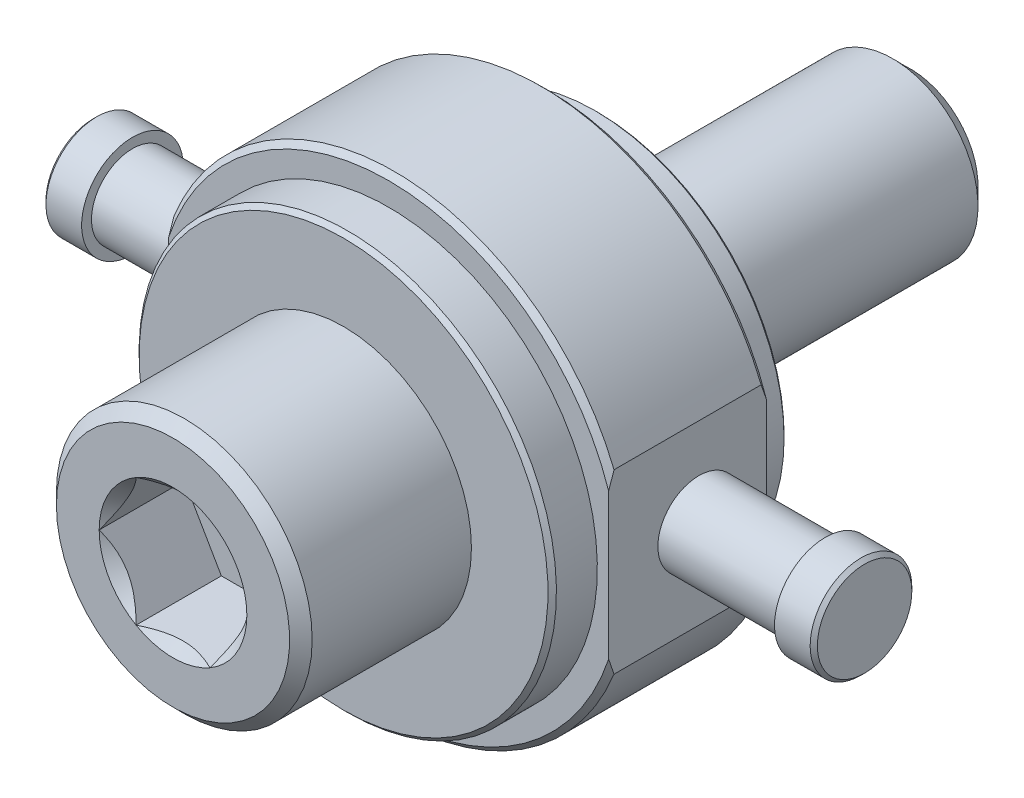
ISO-10303-21;
HEADER;
FILE_DESCRIPTION(('STEP AP214'),'2;1');
FILE_NAME('part.step','',(''),(''),'','','');
FILE_SCHEMA(('AUTOMOTIVE_DESIGN { 1 0 10303 214 1 1 1 1 }'));
ENDSEC;
DATA;
#1=APPLICATION_CONTEXT('core data for automotive mechanical design processes');
#2=APPLICATION_PROTOCOL_DEFINITION('international standard','automotive_design',2000,#1);
#3=PRODUCT_CONTEXT('',#1,'mechanical');
#4=PRODUCT('Part','Part','',(#3));
#5=PRODUCT_RELATED_PRODUCT_CATEGORY('part','',(#4));
#6=PRODUCT_DEFINITION_FORMATION('','',#4);
#7=PRODUCT_DEFINITION_CONTEXT('part definition',#1,'design');
#8=PRODUCT_DEFINITION('design','',#6,#7);
#9=PRODUCT_DEFINITION_SHAPE('','',#8);
#10=(LENGTH_UNIT() NAMED_UNIT(*) SI_UNIT(.MILLI.,.METRE.));
#11=(NAMED_UNIT(*) PLANE_ANGLE_UNIT() SI_UNIT($,.RADIAN.));
#12=(NAMED_UNIT(*) SI_UNIT($,.STERADIAN.) SOLID_ANGLE_UNIT());
#13=UNCERTAINTY_MEASURE_WITH_UNIT(LENGTH_MEASURE(1.E-05),#10,'distance_accuracy_value','');
#14=(GEOMETRIC_REPRESENTATION_CONTEXT(3) GLOBAL_UNCERTAINTY_ASSIGNED_CONTEXT((#13)) GLOBAL_UNIT_ASSIGNED_CONTEXT((#10,
#11,#12)) REPRESENTATION_CONTEXT('',''));
#15=CARTESIAN_POINT('',(0.,0.,0.));
#16=DIRECTION('',(0.,0.,1.));
#17=DIRECTION('',(1.,0.,0.));
#18=AXIS2_PLACEMENT_3D('',#15,#16,#17);
#19=CARTESIAN_POINT('',(97.5106,-14.4846548,18.9925452));
#20=DIRECTION('',(1.,0.,0.));
#21=DIRECTION('',(0.,1.,0.));
#22=AXIS2_PLACEMENT_3D('',#19,#20,#21);
#23=PLANE('',#22);
#24=CARTESIAN_POINT('',(97.5106,0.,33.4772));
#25=DIRECTION('',(1.,0.,0.));
#26=DIRECTION('',(0.,1.,0.));
#27=AXIS2_PLACEMENT_3D('',#24,#25,#26);
#28=CIRCLE('',#27,11.53795);
#29=CARTESIAN_POINT('',(97.5106,11.53795,33.4772));
#30=VERTEX_POINT('',#29);
#31=EDGE_CURVE('E297',#30,#30,#28,.F.);
#32=ORIENTED_EDGE('',*,*,#31,.F.);
#33=EDGE_LOOP('',(#32));
#34=FACE_BOUND('',#33,.T.);
#35=CARTESIAN_POINT('',(97.5106,0.,33.4772));
#36=DIRECTION('',(1.,0.,0.));
#37=DIRECTION('',(0.,1.,0.));
#38=AXIS2_PLACEMENT_3D('',#35,#36,#37);
#39=CIRCLE('',#38,14.3129);
#40=CARTESIAN_POINT('',(97.5106,14.3129,33.4772));
#41=VERTEX_POINT('',#40);
#42=EDGE_CURVE('E24',#41,#41,#39,.F.);
#43=ORIENTED_EDGE('',*,*,#42,.T.);
#44=EDGE_LOOP('',(#43));
#45=FACE_BOUND('',#44,.T.);
#46=ADVANCED_FACE('F14',(#34,#45),#23,.F.);
#47=CARTESIAN_POINT('',(-97.5106,14.4846548,18.9925452));
#48=DIRECTION('',(-1.,0.,0.));
#49=DIRECTION('',(0.,-1.,0.));
#50=AXIS2_PLACEMENT_3D('',#47,#48,#49);
#51=PLANE('',#50);
#52=CARTESIAN_POINT('',(-97.5106,0.,33.4772));
#53=DIRECTION('',(1.,0.,0.));
#54=DIRECTION('',(0.,1.,0.));
#55=AXIS2_PLACEMENT_3D('',#52,#53,#54);
#56=CIRCLE('',#55,11.53795);
#57=CARTESIAN_POINT('',(-97.5106,11.53795,33.4772));
#58=VERTEX_POINT('',#57);
#59=EDGE_CURVE('E434',#58,#58,#56,.F.);
#60=ORIENTED_EDGE('',*,*,#59,.T.);
#61=EDGE_LOOP('',(#60));
#62=FACE_BOUND('',#61,.T.);
#63=CARTESIAN_POINT('',(-97.5106,0.,33.4772));
#64=DIRECTION('',(1.,0.,0.));
#65=DIRECTION('',(0.,0.,-1.));
#66=AXIS2_PLACEMENT_3D('',#63,#64,#65);
#67=CIRCLE('',#66,14.3129);
#68=CARTESIAN_POINT('',(-97.5106,0.,19.1643));
#69=VERTEX_POINT('',#68);
#70=EDGE_CURVE('E340',#69,#69,#67,.F.);
#71=ORIENTED_EDGE('',*,*,#70,.F.);
#72=EDGE_LOOP('',(#71));
#73=FACE_BOUND('',#72,.T.);
#74=ADVANCED_FACE('F322',(#62,#73),#51,.F.);
#75=CARTESIAN_POINT('',(20.784609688,-17.9999999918,95.577200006));
#76=DIRECTION('',(0.,0.,1.));
#77=DIRECTION('',(0.,1.,0.));
#78=AXIS2_PLACEMENT_3D('',#75,#76,#77);
#79=PLANE('',#78);
#80=DIRECTION('',(0.500000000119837,-0.866025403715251,0.));
#81=VECTOR('',#80,1.);
#82=CARTESIAN_POINT('',(-15.588457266,-8.9999999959,95.577200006));
#83=LINE('',#82,#81);
#84=CARTESIAN_POINT('',(-20.784609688,0.,95.577200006));
#85=VERTEX_POINT('',#84);
#86=CARTESIAN_POINT('',(-10.392304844,-17.9999999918,95.577200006));
#87=VERTEX_POINT('',#86);
#88=EDGE_CURVE('E431',#85,#87,#83,.T.);
#89=ORIENTED_EDGE('',*,*,#88,.T.);
#90=DIRECTION('',(1.,0.,0.));
#91=VECTOR('',#90,1.);
#92=CARTESIAN_POINT('',(0.,-17.9999999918,95.577200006));
#93=LINE('',#92,#91);
#94=CARTESIAN_POINT('',(10.392304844,-17.9999999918,95.577200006));
#95=VERTEX_POINT('',#94);
#96=EDGE_CURVE('E413',#87,#95,#93,.T.);
#97=ORIENTED_EDGE('',*,*,#96,.T.);
#98=DIRECTION('',(0.500000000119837,0.866025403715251,0.));
#99=VECTOR('',#98,1.);
#100=CARTESIAN_POINT('',(15.588457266,-8.9999999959,95.577200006));
#101=LINE('',#100,#99);
#102=CARTESIAN_POINT('',(20.784609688,0.,95.577200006));
#103=VERTEX_POINT('',#102);
#104=EDGE_CURVE('E96',#95,#103,#101,.T.);
#105=ORIENTED_EDGE('',*,*,#104,.T.);
#106=DIRECTION('',(-0.500000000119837,0.866025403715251,0.));
#107=VECTOR('',#106,1.);
#108=CARTESIAN_POINT('',(15.588457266,8.9999999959,95.577200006));
#109=LINE('',#108,#107);
#110=CARTESIAN_POINT('',(10.392304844,17.9999999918,95.577200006));
#111=VERTEX_POINT('',#110);
#112=EDGE_CURVE('E412',#103,#111,#109,.T.);
#113=ORIENTED_EDGE('',*,*,#112,.T.);
#114=DIRECTION('',(-1.,0.,0.));
#115=VECTOR('',#114,1.);
#116=CARTESIAN_POINT('',(0.,17.9999999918,95.577200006));
#117=LINE('',#116,#115);
#118=CARTESIAN_POINT('',(-10.392304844,17.9999999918,95.577200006));
#119=VERTEX_POINT('',#118);
#120=EDGE_CURVE('E418',#111,#119,#117,.T.);
#121=ORIENTED_EDGE('',*,*,#120,.T.);
#122=DIRECTION('',(-0.500000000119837,-0.866025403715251,0.));
#123=VECTOR('',#122,1.);
#124=CARTESIAN_POINT('',(-15.588457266,8.9999999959,95.577200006));
#125=LINE('',#124,#123);
#126=EDGE_CURVE('E423',#119,#85,#125,.T.);
#127=ORIENTED_EDGE('',*,*,#126,.T.);
#128=EDGE_LOOP('',(#89,#97,#105,#113,#121,#127));
#129=FACE_BOUND('',#128,.T.);
#130=ADVANCED_FACE('F329',(#129),#79,.T.);
#131=CARTESIAN_POINT('',(-10.392304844,17.9999999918,95.577200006));
#132=DIRECTION('',(-0.866025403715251,0.500000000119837,0.));
#133=DIRECTION('',(-0.500000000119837,-0.866025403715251,0.));
#134=AXIS2_PLACEMENT_3D('',#131,#132,#133);
#135=PLANE('',#134);
#136=CARTESIAN_POINT('',(-20.7846096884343,-7.52261688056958E-10,119.577200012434));
#137=CARTESIAN_POINT('',(-20.6059484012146,0.309450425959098,119.398569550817));
#138=CARTESIAN_POINT('',(-20.425887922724,0.621324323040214,119.225390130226));
#139=CARTESIAN_POINT('',(-20.062750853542,1.25029617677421,118.891664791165));
#140=CARTESIAN_POINT('',(-19.8796726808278,1.56739687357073,118.731125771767));
#141=CARTESIAN_POINT('',(-19.5094190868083,2.20869490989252,118.423732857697));
#142=CARTESIAN_POINT('',(-19.322226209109,2.53292248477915,118.276962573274));
#143=CARTESIAN_POINT('',(-18.9447658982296,3.18670292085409,118.000294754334));
#144=CARTESIAN_POINT('',(-18.7544989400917,3.51625495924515,117.870394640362));
#145=CARTESIAN_POINT('',(-18.3739501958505,4.17538471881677,117.631576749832));
#146=CARTESIAN_POINT('',(-18.1837151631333,4.50488146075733,117.522362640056));
#147=CARTESIAN_POINT('',(-17.8005763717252,5.16849731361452,117.324641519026));
#148=CARTESIAN_POINT('',(-17.6076728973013,5.50261593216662,117.236132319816));
#149=CARTESIAN_POINT('',(-17.2200311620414,6.17403111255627,117.082045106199));
#150=CARTESIAN_POINT('',(-17.025298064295,6.51131873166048,117.016415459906));
#151=CARTESIAN_POINT('',(-16.634172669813,7.18876778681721,116.909545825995));
#152=CARTESIAN_POINT('',(-16.4377806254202,7.52892878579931,116.868302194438));
#153=CARTESIAN_POINT('',(-16.1000729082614,8.11385570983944,116.819457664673));
#154=CARTESIAN_POINT('',(-15.9589759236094,8.35824285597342,116.805625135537));
#155=CARTESIAN_POINT('',(-15.6766152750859,8.84730584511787,116.791241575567));
#156=CARTESIAN_POINT('',(-15.5353516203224,9.09198167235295,116.790689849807));
#157=CARTESIAN_POINT('',(-15.2529182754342,9.58117057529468,116.802881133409));
#158=CARTESIAN_POINT('',(-15.1117486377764,9.82568356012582,116.815628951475));
#159=CARTESIAN_POINT('',(-14.8298577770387,10.3139328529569,116.854229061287));
#160=CARTESIAN_POINT('',(-14.689136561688,10.5576691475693,116.880081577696));
#161=CARTESIAN_POINT('',(-14.4082817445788,11.0441239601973,116.944541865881));
#162=CARTESIAN_POINT('',(-14.2681488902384,11.286841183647,116.983162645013));
#163=CARTESIAN_POINT('',(-13.988855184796,11.7705920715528,117.072602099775));
#164=CARTESIAN_POINT('',(-13.8496944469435,12.0116255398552,117.123422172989));
#165=CARTESIAN_POINT('',(-13.4340476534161,12.7315469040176,117.293185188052));
#166=CARTESIAN_POINT('',(-13.1592922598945,13.2074372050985,117.429455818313));
#167=CARTESIAN_POINT('',(-12.6716290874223,14.0520945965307,117.709782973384));
#168=CARTESIAN_POINT('',(-12.4576317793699,14.422748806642,117.84646333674));
#169=CARTESIAN_POINT('',(-12.0334699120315,15.1574187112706,118.141847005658));
#170=CARTESIAN_POINT('',(-11.8233054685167,15.5214342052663,118.300550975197));
#171=CARTESIAN_POINT('',(-11.4074816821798,16.2416621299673,118.636424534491));
#172=CARTESIAN_POINT('',(-11.2018105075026,16.5978950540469,118.81353604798));
#173=CARTESIAN_POINT('',(-10.7942760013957,17.3037655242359,119.183900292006));
#174=CARTESIAN_POINT('',(-10.5924104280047,17.6534069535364,119.377143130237));
#175=CARTESIAN_POINT('',(-10.3923048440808,17.9999999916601,119.577200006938));
#176=B_SPLINE_CURVE_WITH_KNOTS('',3,(#136,#137,#138,#139,#140,#141,#142,#143,#144,#145,#146,
#147,#148,#149,#150,#151,#152,#153,#154,#155,#156,#157,#158,#159,#160,#161,#162,#163,#164,#165,
#166,#167,#168,#169,#170,#171,#172,#173,#174,#175),.UNSPECIFIED.,.F.,.F.,(4,2,2,2,2,2,2,2,2,2,2,
2,2,2,2,2,2,2,2,4),(0.,1.19850578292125,2.3976612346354,3.60368193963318,4.80951802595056,
5.99649880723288,7.18335409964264,8.36751343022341,9.55149577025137,10.3988045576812,
11.2460690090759,12.0936399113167,12.9412253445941,13.7896769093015,14.6382257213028,
16.3346924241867,17.6819660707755,19.0292803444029,20.3724659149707,21.7148337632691),.UNSPECIFIED.);
#177=CARTESIAN_POINT('',(-20.784609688,-2.13149735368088E-09,119.577200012));
#178=VERTEX_POINT('',#177);
#179=CARTESIAN_POINT('',(-10.3923048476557,17.9999999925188,119.577200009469));
#180=VERTEX_POINT('',#179);
#181=EDGE_CURVE('E463',#178,#180,#176,.T.);
#182=ORIENTED_EDGE('',*,*,#181,.F.);
#183=DIRECTION('',(0.,0.,1.));
#184=VECTOR('',#183,1.);
#185=CARTESIAN_POINT('',(-20.784609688,0.,107.6492000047));
#186=LINE('',#185,#184);
#187=EDGE_CURVE('E447',#85,#178,#186,.T.);
#188=ORIENTED_EDGE('',*,*,#187,.F.);
#189=ORIENTED_EDGE('',*,*,#126,.F.);
#190=DIRECTION('',(0.,0.,1.));
#191=VECTOR('',#190,1.);
#192=CARTESIAN_POINT('',(-10.392304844,17.9999999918,107.6492000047));
#193=LINE('',#192,#191);
#194=EDGE_CURVE('E428',#119,#180,#193,.T.);
#195=ORIENTED_EDGE('',*,*,#194,.T.);
#196=EDGE_LOOP('',(#182,#188,#189,#195));
#197=FACE_BOUND('',#196,.T.);
#198=ADVANCED_FACE('F485',(#197),#135,.F.);
#199=CARTESIAN_POINT('',(-20.784609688,0.,95.577200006));
#200=DIRECTION('',(-0.866025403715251,-0.500000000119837,0.));
#201=DIRECTION('',(0.500000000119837,-0.866025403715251,0.));
#202=AXIS2_PLACEMENT_3D('',#199,#200,#201);
#203=PLANE('',#202);
#204=CARTESIAN_POINT('',(-10.3923048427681,-17.9999999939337,119.57720000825));
#205=CARTESIAN_POINT('',(-10.5709661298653,-17.6905495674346,119.398569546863));
#206=CARTESIAN_POINT('',(-10.7510266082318,-17.3786756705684,119.2253901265));
#207=CARTESIAN_POINT('',(-11.1141636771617,-16.7497038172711,118.891664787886));
#208=CARTESIAN_POINT('',(-11.2972418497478,-16.4326031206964,118.731125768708));
#209=CARTESIAN_POINT('',(-11.6674954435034,-15.7913050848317,118.423732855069));
#210=CARTESIAN_POINT('',(-11.8546883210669,-15.4670775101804,118.276962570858));
#211=CARTESIAN_POINT('',(-12.2321486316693,-14.8132970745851,118.000294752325));
#212=CARTESIAN_POINT('',(-12.4224155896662,-14.4837450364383,117.870394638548));
#213=CARTESIAN_POINT('',(-12.8029643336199,-13.8246152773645,117.631576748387));
#214=CARTESIAN_POINT('',(-12.9931993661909,-13.4951185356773,117.522362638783));
#215=CARTESIAN_POINT('',(-13.3763381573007,-12.8315026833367,117.324641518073));
#216=CARTESIAN_POINT('',(-13.5692416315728,-12.4973840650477,117.23613231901));
#217=CARTESIAN_POINT('',(-13.9568833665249,-11.825968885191,117.082045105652));
#218=CARTESIAN_POINT('',(-14.1516164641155,-11.4886812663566,117.016415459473));
#219=CARTESIAN_POINT('',(-14.5427418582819,-10.8112322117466,116.909545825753));
#220=CARTESIAN_POINT('',(-14.7391339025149,-10.4710712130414,116.868302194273));
#221=CARTESIAN_POINT('',(-15.0768416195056,-9.88614428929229,116.819457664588));
#222=CARTESIAN_POINT('',(-15.2179386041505,-9.64175714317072,116.805625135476));
#223=CARTESIAN_POINT('',(-15.5002992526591,-9.15269415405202,116.791241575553));
#224=CARTESIAN_POINT('',(-15.6415629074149,-8.9080183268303,116.790689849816));
#225=CARTESIAN_POINT('',(-15.9239962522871,-8.4188294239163,116.802881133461));
#226=CARTESIAN_POINT('',(-16.0651658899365,-8.17431643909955,116.815628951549));
#227=CARTESIAN_POINT('',(-16.3470567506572,-7.68606714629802,116.854229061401));
#228=CARTESIAN_POINT('',(-16.4877779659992,-7.44233085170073,116.880081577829));
#229=CARTESIAN_POINT('',(-16.7686327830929,-6.95587603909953,116.944541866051));
#230=CARTESIAN_POINT('',(-16.9087656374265,-6.71315881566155,116.983162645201));
#231=CARTESIAN_POINT('',(-17.1880593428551,-6.22940792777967,117.072602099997));
#232=CARTESIAN_POINT('',(-17.3272200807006,-5.9883744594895,117.123422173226));
#233=CARTESIAN_POINT('',(-17.7428668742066,-5.268453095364,117.293185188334));
#234=CARTESIAN_POINT('',(-18.0176222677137,-4.79256279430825,117.429455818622));
#235=CARTESIAN_POINT('',(-18.5052854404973,-3.94790540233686,117.709782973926));
#236=CARTESIAN_POINT('',(-18.7192827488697,-3.57725119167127,117.846463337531));
#237=CARTESIAN_POINT('',(-19.1434446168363,-2.84258128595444,118.141847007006));
#238=CARTESIAN_POINT('',(-19.3536090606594,-2.47856579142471,118.300550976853));
#239=CARTESIAN_POINT('',(-19.7694328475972,-1.75833786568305,118.636424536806));
#240=CARTESIAN_POINT('',(-19.9751040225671,-1.40210494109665,118.813536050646));
#241=CARTESIAN_POINT('',(-20.3826385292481,-0.696234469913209,119.183900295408));
#242=CARTESIAN_POINT('',(-20.5845041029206,-0.346593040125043,119.377143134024));
#243=CARTESIAN_POINT('',(-20.7846096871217,-1.5213315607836E-09,119.577200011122));
#244=B_SPLINE_CURVE_WITH_KNOTS('',3,(#204,#205,#206,#207,#208,#209,#210,#211,#212,#213,#214,
#215,#216,#217,#218,#219,#220,#221,#222,#223,#224,#225,#226,#227,#228,#229,#230,#231,#232,#233,
#234,#235,#236,#237,#238,#239,#240,#241,#242,#243),.UNSPECIFIED.,.F.,.F.,(4,2,2,2,2,2,2,2,2,2,2,
2,2,2,2,2,2,2,2,4),(0.,1.19850578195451,2.39766123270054,3.60368193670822,4.80951802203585,
5.99649880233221,7.18335409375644,8.36751342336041,9.55149576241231,10.3988045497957,
11.2460690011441,12.093639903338,12.9412253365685,13.7896769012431,14.6382257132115,
16.3346924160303,17.681966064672,19.0292803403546,20.3724659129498,21.7148337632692),.UNSPECIFIED.);
#245=CARTESIAN_POINT('',(-10.3923048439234,-17.9999999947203,119.577200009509));
#246=VERTEX_POINT('',#245);
#247=EDGE_CURVE('E111',#246,#178,#244,.T.);
#248=ORIENTED_EDGE('',*,*,#247,.F.);
#249=DIRECTION('',(0.,0.,1.));
#250=VECTOR('',#249,1.);
#251=CARTESIAN_POINT('',(-10.392304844,-17.9999999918,107.6492000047));
#252=LINE('',#251,#250);
#253=EDGE_CURVE('E106',#87,#246,#252,.T.);
#254=ORIENTED_EDGE('',*,*,#253,.F.);
#255=ORIENTED_EDGE('',*,*,#88,.F.);
#256=ORIENTED_EDGE('',*,*,#187,.T.);
#257=EDGE_LOOP('',(#248,#254,#255,#256));
#258=FACE_BOUND('',#257,.T.);
#259=ADVANCED_FACE('F444',(#258),#203,.F.);
#260=CARTESIAN_POINT('',(-10.392304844,-17.9999999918,95.577200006));
#261=DIRECTION('',(0.,-1.,0.));
#262=DIRECTION('',(1.,0.,0.));
#263=AXIS2_PLACEMENT_3D('',#260,#261,#262);
#264=PLANE('',#263);
#265=CARTESIAN_POINT('',(10.3923048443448,-17.9999999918,119.577200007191));
#266=CARTESIAN_POINT('',(10.0349822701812,-17.9999999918,119.398569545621));
#267=CARTESIAN_POINT('',(9.67486131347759,-17.9999999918,119.225390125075));
#268=CARTESIAN_POINT('',(8.9485871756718,-17.9999999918,118.891664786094));
#269=CARTESIAN_POINT('',(8.58243083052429,-17.9999999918,118.731125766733));
#270=CARTESIAN_POINT('',(7.84192364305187,-17.9999999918,118.423732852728));
#271=CARTESIAN_POINT('',(7.46753788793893,-17.9999999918,118.276962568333));
#272=CARTESIAN_POINT('',(6.71261726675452,-17.9999999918,118.000294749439));
#273=CARTESIAN_POINT('',(6.33208335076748,-17.9999999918,117.870394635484));
#274=CARTESIAN_POINT('',(5.57098586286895,-17.9999999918,117.631576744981));
#275=CARTESIAN_POINT('',(5.1905157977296,-17.9999999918,117.522362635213));
#276=CARTESIAN_POINT('',(4.42423821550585,-17.9999999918,117.324641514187));
#277=CARTESIAN_POINT('',(4.03843126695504,-17.9999999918,117.236132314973));
#278=CARTESIAN_POINT('',(3.26314779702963,-17.9999999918,117.082045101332));
#279=CARTESIAN_POINT('',(2.87368160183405,-17.9999999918,117.01641545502));
#280=CARTESIAN_POINT('',(2.09143081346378,-17.9999999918,116.909545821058));
#281=CARTESIAN_POINT('',(1.69864672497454,-17.9999999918,116.86830218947));
#282=CARTESIAN_POINT('',(1.02323129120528,-17.9999999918,116.81945765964));
#283=CARTESIAN_POINT('',(0.741037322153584,-17.9999999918,116.805625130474));
#284=CARTESIAN_POINT('',(0.176316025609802,-17.9999999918,116.791241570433));
#285=CARTESIAN_POINT('',(-0.10621128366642,-17.9999999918,116.790689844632));
#286=CARTESIAN_POINT('',(-0.671077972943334,-17.9999999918,116.802881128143));
#287=CARTESIAN_POINT('',(-0.953417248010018,-17.9999999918,116.815628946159));
#288=CARTESIAN_POINT('',(-1.51719896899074,-17.9999999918,116.854229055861));
#289=CARTESIAN_POINT('',(-1.79864139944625,-17.9999999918,116.880081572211));
#290=CARTESIAN_POINT('',(-2.3603510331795,-17.9999999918,116.94454186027));
#291=CARTESIAN_POINT('',(-2.64061674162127,-17.9999999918,116.983162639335));
#292=CARTESIAN_POINT('',(-3.1992041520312,-17.9999999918,117.072602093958));
#293=CARTESIAN_POINT('',(-3.47752562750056,-17.9999999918,117.123422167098));
#294=CARTESIAN_POINT('',(-4.3088192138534,-17.9999999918,117.293185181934));
#295=CARTESIAN_POINT('',(-4.8583300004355,-17.9999999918,117.429455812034));
#296=CARTESIAN_POINT('',(-5.8336563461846,-17.9999999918,117.709782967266));
#297=CARTESIAN_POINT('',(-6.26165096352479,-17.9999999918,117.846463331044));
#298=CARTESIAN_POINT('',(-7.10997470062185,-17.9999999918,118.141847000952));
#299=CARTESIAN_POINT('',(-7.53030358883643,-17.9999999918,118.30055097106));
#300=CARTESIAN_POINT('',(-8.36195116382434,-17.9999999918,118.636424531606));
#301=CARTESIAN_POINT('',(-8.77329351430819,-17.9999999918,118.813536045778));
#302=CARTESIAN_POINT('',(-9.58836252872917,-17.9999999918,119.183900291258));
#303=CARTESIAN_POINT('',(-9.99209367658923,-17.9999999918,119.377143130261));
#304=CARTESIAN_POINT('',(-10.3923048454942,-17.9999999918,119.577200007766));
#305=B_SPLINE_CURVE_WITH_KNOTS('',3,(#265,#266,#267,#268,#269,#270,#271,#272,#273,#274,#275,
#276,#277,#278,#279,#280,#281,#282,#283,#284,#285,#286,#287,#288,#289,#290,#291,#292,#293,#294,
#295,#296,#297,#298,#299,#300,#301,#302,#303,#304),.UNSPECIFIED.,.F.,.F.,(4,2,2,2,2,2,2,2,2,2,2,
2,2,2,2,2,2,2,2,4),(0.,1.19850578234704,2.39766123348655,3.6036819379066,4.80951802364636,
5.99649880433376,7.18335409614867,8.36751342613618,9.55149576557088,10.398804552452,
11.2460690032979,12.0936399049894,12.9412253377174,13.7896769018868,14.63822571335,
16.3346924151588,17.681966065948,19.0292803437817,20.3724659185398,21.7148337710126),.UNSPECIFIED.);
#306=CARTESIAN_POINT('',(10.3923048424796,-17.9999999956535,119.577200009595));
#307=VERTEX_POINT('',#306);
#308=EDGE_CURVE('E103',#307,#246,#305,.T.);
#309=ORIENTED_EDGE('',*,*,#308,.F.);
#310=DIRECTION('',(0.,0.,1.));
#311=VECTOR('',#310,1.);
#312=CARTESIAN_POINT('',(10.392304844,-17.9999999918,107.6492000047));
#313=LINE('',#312,#311);
#314=EDGE_CURVE('E91',#95,#307,#313,.T.);
#315=ORIENTED_EDGE('',*,*,#314,.F.);
#316=ORIENTED_EDGE('',*,*,#96,.F.);
#317=ORIENTED_EDGE('',*,*,#253,.T.);
#318=EDGE_LOOP('',(#309,#315,#316,#317));
#319=FACE_BOUND('',#318,.T.);
#320=ADVANCED_FACE('F104',(#319),#264,.F.);
#321=CARTESIAN_POINT('',(10.392304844,-17.9999999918,95.577200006));
#322=DIRECTION('',(0.866025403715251,-0.500000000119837,0.));
#323=DIRECTION('',(0.500000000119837,0.866025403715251,0.));
#324=AXIS2_PLACEMENT_3D('',#321,#322,#323);
#325=PLANE('',#324);
#326=CARTESIAN_POINT('',(20.784609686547,-2.51669599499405E-09,119.577200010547));
#327=CARTESIAN_POINT('',(20.6059483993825,-0.309450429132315,119.398569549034));
#328=CARTESIAN_POINT('',(20.425887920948,-0.621324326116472,119.225390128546));
#329=CARTESIAN_POINT('',(20.0627508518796,-1.25029617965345,118.891664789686));
#330=CARTESIAN_POINT('',(19.8796726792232,-1.56739687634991,118.731125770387));
#331=CARTESIAN_POINT('',(19.5094190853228,-2.20869491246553,118.423732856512));
#332=CARTESIAN_POINT('',(19.3222262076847,-2.53292248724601,118.276962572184));
#333=CARTESIAN_POINT('',(18.9447658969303,-3.1867029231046,118.000294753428));
#334=CARTESIAN_POINT('',(18.754498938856,-3.51625496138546,117.870394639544));
#335=CARTESIAN_POINT('',(18.3739501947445,-4.17538472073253,117.63157674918));
#336=CARTESIAN_POINT('',(18.1837151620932,-4.50488146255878,117.522362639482));
#337=CARTESIAN_POINT('',(17.8005763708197,-5.16849731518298,117.324641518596));
#338=CARTESIAN_POINT('',(17.6076728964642,-5.50261593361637,117.236132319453));
#339=CARTESIAN_POINT('',(17.2200311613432,-6.17403111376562,117.082045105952));
#340=CARTESIAN_POINT('',(17.0252980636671,-6.51131873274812,117.016415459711));
#341=CARTESIAN_POINT('',(16.6341726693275,-7.18876778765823,116.909545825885));
#342=CARTESIAN_POINT('',(16.4377806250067,-7.5289287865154,116.868302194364));
#343=CARTESIAN_POINT('',(16.1000729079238,-8.11385571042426,116.819457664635));
#344=CARTESIAN_POINT('',(15.958975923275,-8.35824285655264,116.80562513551));
#345=CARTESIAN_POINT('',(15.6766152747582,-8.84730584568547,116.791241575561));
#346=CARTESIAN_POINT('',(15.5353516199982,-9.09198167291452,116.790689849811));
#347=CARTESIAN_POINT('',(15.2529182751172,-9.58117057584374,116.802881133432));
#348=CARTESIAN_POINT('',(15.1117486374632,-9.82568356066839,116.815628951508));
#349=CARTESIAN_POINT('',(14.8298577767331,-10.3139328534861,116.854229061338));
#350=CARTESIAN_POINT('',(14.6891365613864,-10.5576691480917,116.880081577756));
#351=CARTESIAN_POINT('',(14.4082817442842,-11.0441239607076,116.944541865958));
#352=CARTESIAN_POINT('',(14.2681488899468,-11.2868411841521,116.983162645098));
#353=CARTESIAN_POINT('',(13.9888551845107,-11.7705920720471,117.072602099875));
#354=CARTESIAN_POINT('',(13.8496944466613,-12.0116255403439,117.123422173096));
#355=CARTESIAN_POINT('',(13.4340476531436,-12.7315469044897,117.293185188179));
#356=CARTESIAN_POINT('',(13.1592922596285,-13.2074372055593,117.429455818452));
#357=CARTESIAN_POINT('',(12.6716290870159,-14.0520945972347,117.709782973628));
#358=CARTESIAN_POINT('',(12.4576317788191,-14.422748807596,117.846463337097));
#359=CARTESIAN_POINT('',(12.0334699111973,-15.1574187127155,118.141847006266));
#360=CARTESIAN_POINT('',(11.8233054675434,-15.5214342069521,118.300550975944));
#361=CARTESIAN_POINT('',(11.4074816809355,-16.2416621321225,118.636424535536));
#362=CARTESIAN_POINT('',(11.2018105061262,-16.5978950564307,118.813536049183));
#363=CARTESIAN_POINT('',(10.7942759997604,-17.3037655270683,119.183900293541));
#364=CARTESIAN_POINT('',(10.5924104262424,-17.6534069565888,119.377143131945));
#365=CARTESIAN_POINT('',(10.3923048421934,-17.9999999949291,119.577200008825));
#366=B_SPLINE_CURVE_WITH_KNOTS('',3,(#326,#327,#328,#329,#330,#331,#332,#333,#334,#335,#336,
#337,#338,#339,#340,#341,#342,#343,#344,#345,#346,#347,#348,#349,#350,#351,#352,#353,#354,#355,
#356,#357,#358,#359,#360,#361,#362,#363,#364,#365),.UNSPECIFIED.,.F.,.F.,(4,2,2,2,2,2,2,2,2,2,2,
2,2,2,2,2,2,2,2,4),(0.,1.19850578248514,2.39766123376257,3.60368193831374,4.80951802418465,
5.99649880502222,7.18335409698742,8.36751342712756,9.55149576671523,10.3988045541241,
11.2460690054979,12.0936399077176,12.9412253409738,13.7896769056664,14.6382257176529,
16.3346924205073,17.6819660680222,19.0292803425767,20.3724659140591,21.7148337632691),.UNSPECIFIED.);
#367=CARTESIAN_POINT('',(20.784609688,-3.99781277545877E-09,119.577200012));
#368=VERTEX_POINT('',#367);
#369=EDGE_CURVE('E87',#368,#307,#366,.T.);
#370=ORIENTED_EDGE('',*,*,#369,.F.);
#371=DIRECTION('',(0.,0.,-1.));
#372=VECTOR('',#371,1.);
#373=CARTESIAN_POINT('',(20.784609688,0.,107.6492000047));
#374=LINE('',#373,#372);
#375=EDGE_CURVE('E100',#368,#103,#374,.T.);
#376=ORIENTED_EDGE('',*,*,#375,.T.);
#377=ORIENTED_EDGE('',*,*,#104,.F.);
#378=ORIENTED_EDGE('',*,*,#314,.T.);
#379=EDGE_LOOP('',(#370,#376,#377,#378));
#380=FACE_BOUND('',#379,.T.);
#381=ADVANCED_FACE('F93',(#380),#325,.F.);
#382=CARTESIAN_POINT('',(20.784609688,0.,95.577200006));
#383=DIRECTION('',(0.866025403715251,0.500000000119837,0.));
#384=DIRECTION('',(-0.500000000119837,0.866025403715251,0.));
#385=AXIS2_PLACEMENT_3D('',#382,#383,#384);
#386=PLANE('',#385);
#387=CARTESIAN_POINT('',(10.3923048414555,17.9999999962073,119.577200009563));
#388=CARTESIAN_POINT('',(10.5709661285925,17.6905495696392,119.398569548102));
#389=CARTESIAN_POINT('',(10.7510266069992,17.3786756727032,119.225390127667));
#390=CARTESIAN_POINT('',(11.1141636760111,16.749703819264,118.891664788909));
#391=CARTESIAN_POINT('',(11.2972418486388,16.4326031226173,118.731125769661));
#392=CARTESIAN_POINT('',(11.6674954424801,15.7913050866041,118.423732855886));
#393=CARTESIAN_POINT('',(11.8546883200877,15.4670775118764,118.276962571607));
#394=CARTESIAN_POINT('',(12.23214863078,14.8132970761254,118.000294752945));
#395=CARTESIAN_POINT('',(12.4224155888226,14.4837450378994,117.870394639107));
#396=CARTESIAN_POINT('',(12.8029643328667,13.8246152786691,117.631576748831));
#397=CARTESIAN_POINT('',(12.9931993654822,13.4951185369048,117.522362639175));
#398=CARTESIAN_POINT('',(13.3763381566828,12.8315026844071,117.324641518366));
#399=CARTESIAN_POINT('',(13.569241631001,12.497384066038,117.236132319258));
#400=CARTESIAN_POINT('',(13.9568833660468,11.8259688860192,117.082045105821));
#401=CARTESIAN_POINT('',(14.1516164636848,11.4886812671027,117.016415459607));
#402=CARTESIAN_POINT('',(14.5427418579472,10.8112322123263,116.909545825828));
#403=CARTESIAN_POINT('',(14.7391339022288,10.4710712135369,116.868302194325));
#404=CARTESIAN_POINT('',(15.0768416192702,9.88614428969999,116.819457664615));
#405=CARTESIAN_POINT('',(15.2179386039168,9.64175714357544,116.805625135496));
#406=CARTESIAN_POINT('',(15.500299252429,9.1526941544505,116.791241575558));
#407=CARTESIAN_POINT('',(15.6415629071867,8.90801832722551,116.790689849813));
#408=CARTESIAN_POINT('',(15.9239962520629,8.41882942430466,116.802881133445));
#409=CARTESIAN_POINT('',(16.0651658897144,8.17431643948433,116.815628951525));
#410=CARTESIAN_POINT('',(16.3470567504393,7.6860671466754,116.854229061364));
#411=CARTESIAN_POINT('',(16.4877779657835,7.44233085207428,116.880081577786));
#412=CARTESIAN_POINT('',(16.7686327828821,6.95587603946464,116.944541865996));
#413=CARTESIAN_POINT('',(16.9087656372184,6.71315881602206,116.98316264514));
#414=CARTESIAN_POINT('',(17.1880593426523,6.22940792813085,117.072602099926));
#415=CARTESIAN_POINT('',(17.3272200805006,5.98837445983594,117.12342217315));
#416=CARTESIAN_POINT('',(17.7428668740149,5.26845309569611,117.293185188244));
#417=CARTESIAN_POINT('',(18.0176222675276,4.79256279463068,117.429455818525));
#418=CARTESIAN_POINT('',(18.5052854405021,3.94790540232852,117.709782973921));
#419=CARTESIAN_POINT('',(18.7192827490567,3.57725119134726,117.846463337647));
#420=CARTESIAN_POINT('',(19.1434446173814,2.84258128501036,118.141847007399));
#421=CARTESIAN_POINT('',(19.3536090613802,2.47856579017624,118.300550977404));
#422=CARTESIAN_POINT('',(19.7694328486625,1.75833786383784,118.636424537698));
#423=CARTESIAN_POINT('',(19.9751040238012,1.40210493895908,118.813536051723));
#424=CARTESIAN_POINT('',(20.3826385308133,0.696234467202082,119.183900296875));
#425=CARTESIAN_POINT('',(20.5845041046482,0.346593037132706,119.377143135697));
#426=CARTESIAN_POINT('',(20.784609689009,-1.74763774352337E-09,119.577200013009));
#427=B_SPLINE_CURVE_WITH_KNOTS('',3,(#387,#388,#389,#390,#391,#392,#393,#394,#395,#396,#397,
#398,#399,#400,#401,#402,#403,#404,#405,#406,#407,#408,#409,#410,#411,#412,#413,#414,#415,#416,
#417,#418,#419,#420,#421,#422,#423,#424,#425,#426),.UNSPECIFIED.,.F.,.F.,(4,2,2,2,2,2,2,2,2,2,2,
2,2,2,2,2,2,2,2,4),(0.,1.19850578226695,2.39766123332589,3.60368193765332,4.80951802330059,
5.99649880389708,7.18335409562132,8.36751342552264,9.55149576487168,10.3988045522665,
11.2460690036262,12.0936399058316,12.9412253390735,13.7896769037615,14.6382257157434,
16.3346924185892,17.6819660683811,19.0292803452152,20.3724659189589,21.7148337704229),.UNSPECIFIED.);
#428=CARTESIAN_POINT('',(10.3923048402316,17.9999999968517,119.577200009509));
#429=VERTEX_POINT('',#428);
#430=EDGE_CURVE('E119',#429,#368,#427,.T.);
#431=ORIENTED_EDGE('',*,*,#430,.F.);
#432=DIRECTION('',(0.,0.,1.));
#433=VECTOR('',#432,1.);
#434=CARTESIAN_POINT('',(10.392304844,17.9999999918,107.6492000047));
#435=LINE('',#434,#433);
#436=EDGE_CURVE('E99',#111,#429,#435,.T.);
#437=ORIENTED_EDGE('',*,*,#436,.F.);
#438=ORIENTED_EDGE('',*,*,#112,.F.);
#439=ORIENTED_EDGE('',*,*,#375,.F.);
#440=EDGE_LOOP('',(#431,#437,#438,#439));
#441=FACE_BOUND('',#440,.T.);
#442=ADVANCED_FACE('F154',(#441),#386,.F.);
#443=CARTESIAN_POINT('',(10.392304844,17.9999999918,95.577200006));
#444=DIRECTION('',(0.,1.,0.));
#445=DIRECTION('',(-1.,0.,0.));
#446=AXIS2_PLACEMENT_3D('',#443,#444,#445);
#447=PLANE('',#446);
#448=CARTESIAN_POINT('',(-10.3923048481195,17.9999999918,119.577200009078));
#449=CARTESIAN_POINT('',(-10.0373160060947,17.9999999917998,119.399735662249));
#450=CARTESIAN_POINT('',(-9.67956585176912,17.9999999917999,119.227652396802));
#451=CARTESIAN_POINT('',(-8.95811286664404,17.9999999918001,118.895942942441));
#452=CARTESIAN_POINT('',(-8.59440692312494,17.9999999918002,118.73632353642));
#453=CARTESIAN_POINT('',(-7.85867931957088,17.9999999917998,118.430469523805));
#454=CARTESIAN_POINT('',(-7.48661964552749,17.9999999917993,118.284325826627));
#455=CARTESIAN_POINT('',(-6.73642703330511,17.9999999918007,118.008671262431));
#456=CARTESIAN_POINT('',(-6.358295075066,17.9999999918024,117.879157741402));
#457=CARTESIAN_POINT('',(-5.59727370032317,17.9999999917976,117.639327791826));
#458=CARTESIAN_POINT('',(-5.21440315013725,17.999999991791,117.528951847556));
#459=CARTESIAN_POINT('',(-4.44324454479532,17.999999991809,117.329143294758));
#460=CARTESIAN_POINT('',(-4.05495712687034,17.9999999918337,117.239708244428));
#461=CARTESIAN_POINT('',(-3.27484260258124,17.9999999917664,117.084089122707));
#462=CARTESIAN_POINT('',(-2.88302827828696,17.9999999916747,117.017841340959));
#463=CARTESIAN_POINT('',(-2.09609307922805,17.9999999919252,116.910036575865));
#464=CARTESIAN_POINT('',(-1.70097334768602,17.9999999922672,116.868471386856));
#465=CARTESIAN_POINT('',(-1.08778126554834,17.9999999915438,116.824125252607));
#466=CARTESIAN_POINT('',(-0.870329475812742,17.9999999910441,116.812306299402));
#467=CARTESIAN_POINT('',(-0.435253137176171,17.9999999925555,116.796540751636));
#468=CARTESIAN_POINT('',(-0.217628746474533,17.999999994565,116.792589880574));
#469=CARTESIAN_POINT('',(0.273160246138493,17.9999999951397,116.79259080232));
#470=CARTESIAN_POINT('',(0.546327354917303,17.999999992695,116.798816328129));
#471=CARTESIAN_POINT('',(1.09211710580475,17.9999999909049,116.823629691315));
#472=CARTESIAN_POINT('',(1.3647396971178,17.9999999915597,116.842218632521));
#473=CARTESIAN_POINT('',(1.90904567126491,17.9999999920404,116.891511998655));
#474=CARTESIAN_POINT('',(2.18072842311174,17.9999999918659,116.922223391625));
#475=CARTESIAN_POINT('',(2.72252617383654,17.9999999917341,116.995338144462));
#476=CARTESIAN_POINT('',(2.99264099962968,17.999999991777,117.037742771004));
#477=CARTESIAN_POINT('',(3.80245036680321,17.9999999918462,117.182151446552));
#478=CARTESIAN_POINT('',(4.33918595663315,17.9999999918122,117.301123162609));
#479=CARTESIAN_POINT('',(5.4022131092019,17.9999999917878,117.578760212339));
#480=CARTESIAN_POINT('',(5.92850254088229,17.9999999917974,117.737433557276));
#481=CARTESIAN_POINT('',(6.78884624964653,17.9999999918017,118.027611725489));
#482=CARTESIAN_POINT('',(7.12622242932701,17.9999999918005,118.149431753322));
#483=CARTESIAN_POINT('',(7.7960187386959,17.9999999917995,118.405907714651));
#484=CARTESIAN_POINT('',(8.12843936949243,17.9999999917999,118.540562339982));
#485=CARTESIAN_POINT('',(8.78542106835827,17.9999999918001,118.819970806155));
#486=CARTESIAN_POINT('',(9.11002609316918,17.9999999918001,118.964621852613));
#487=CARTESIAN_POINT('',(9.75458991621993,17.9999999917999,119.263808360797));
#488=CARTESIAN_POINT('',(10.0745494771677,17.9999999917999,119.418342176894));
#489=CARTESIAN_POINT('',(10.3923048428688,17.9999999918,119.577200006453));
#490=B_SPLINE_CURVE_WITH_KNOTS('',3,(#448,#449,#450,#451,#452,#453,#454,#455,#456,#457,#458,
#459,#460,#461,#462,#463,#464,#465,#466,#467,#468,#469,#470,#471,#472,#473,#474,#475,#476,#477,
#478,#479,#480,#481,#482,#483,#484,#485,#486,#487,#488,#489),.UNSPECIFIED.,.F.,.F.,(4,2,2,2,2,2,
2,2,2,2,2,2,2,2,2,2,2,2,2,2,4),(0.,1.19067725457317,2.38199802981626,3.58084345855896,
4.77949732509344,5.97435391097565,7.16907110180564,8.36047937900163,9.5514913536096,
10.2046858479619,10.8575252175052,11.6769471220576,12.4964421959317,13.3164090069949,
14.1364646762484,15.7838556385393,17.4315792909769,18.5074122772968,19.5831357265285,
20.6490923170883,21.7148718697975),.UNSPECIFIED.);
#491=EDGE_CURVE('E146',#180,#429,#490,.T.);
#492=ORIENTED_EDGE('',*,*,#491,.F.);
#493=ORIENTED_EDGE('',*,*,#194,.F.);
#494=ORIENTED_EDGE('',*,*,#120,.F.);
#495=ORIENTED_EDGE('',*,*,#436,.T.);
#496=EDGE_LOOP('',(#492,#493,#494,#495));
#497=FACE_BOUND('',#496,.T.);
#498=ADVANCED_FACE('F491',(#497),#447,.F.);
#499=CARTESIAN_POINT('',(0.,0.,116.775198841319));
#500=DIRECTION('',(0.,0.,1.));
#501=DIRECTION('',(0.,1.,0.));
#502=AXIS2_PLACEMENT_3D('',#499,#500,#501);
#503=CONICAL_SURFACE('',#502,17.9826085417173,0.785398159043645);
#504=ORIENTED_EDGE('',*,*,#181,.T.);
#505=CARTESIAN_POINT('',(0.,0.,119.577200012));
#506=DIRECTION('',(0.,0.,1.));
#507=DIRECTION('',(0.,1.,0.));
#508=AXIS2_PLACEMENT_3D('',#505,#506,#507);
#509=CIRCLE('',#508,20.784609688);
#510=EDGE_CURVE('E849',#178,#180,#509,.F.);
#511=ORIENTED_EDGE('',*,*,#510,.F.);
#512=EDGE_LOOP('',(#504,#511));
#513=FACE_BOUND('',#512,.T.);
#514=ADVANCED_FACE('F487',(#513),#503,.F.);
#515=CARTESIAN_POINT('',(0.,0.,116.775198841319));
#516=DIRECTION('',(0.,0.,1.));
#517=DIRECTION('',(0.,1.,0.));
#518=AXIS2_PLACEMENT_3D('',#515,#516,#517);
#519=CONICAL_SURFACE('',#518,17.9826085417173,0.785398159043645);
#520=ORIENTED_EDGE('',*,*,#247,.T.);
#521=CARTESIAN_POINT('',(0.,0.,119.577200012));
#522=DIRECTION('',(0.,0.,1.));
#523=DIRECTION('',(0.,1.,0.));
#524=AXIS2_PLACEMENT_3D('',#521,#522,#523);
#525=CIRCLE('',#524,20.784609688);
#526=EDGE_CURVE('E126',#246,#178,#525,.F.);
#527=ORIENTED_EDGE('',*,*,#526,.F.);
#528=EDGE_LOOP('',(#520,#527));
#529=FACE_BOUND('',#528,.T.);
#530=ADVANCED_FACE('F490',(#529),#519,.F.);
#531=CARTESIAN_POINT('',(0.,0.,116.775861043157));
#532=DIRECTION('',(0.,0.,1.));
#533=DIRECTION('',(1.,0.,0.));
#534=AXIS2_PLACEMENT_3D('',#531,#532,#533);
#535=CONICAL_SURFACE('',#534,17.983270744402,0.785398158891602);
#536=ORIENTED_EDGE('',*,*,#308,.T.);
#537=CARTESIAN_POINT('',(0.,0.,119.577200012));
#538=DIRECTION('',(0.,0.,1.));
#539=DIRECTION('',(1.,0.,0.));
#540=AXIS2_PLACEMENT_3D('',#537,#538,#539);
#541=CIRCLE('',#540,20.784609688);
#542=EDGE_CURVE('E122',#307,#246,#541,.F.);
#543=ORIENTED_EDGE('',*,*,#542,.F.);
#544=EDGE_LOOP('',(#536,#543));
#545=FACE_BOUND('',#544,.T.);
#546=ADVANCED_FACE('F123',(#545),#535,.F.);
#547=CARTESIAN_POINT('',(0.,0.,116.775198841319));
#548=DIRECTION('',(0.,0.,1.));
#549=DIRECTION('',(0.,1.,0.));
#550=AXIS2_PLACEMENT_3D('',#547,#548,#549);
#551=CONICAL_SURFACE('',#550,17.9826085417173,0.785398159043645);
#552=ORIENTED_EDGE('',*,*,#369,.T.);
#553=CARTESIAN_POINT('',(0.,0.,119.577200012));
#554=DIRECTION('',(0.,0.,1.));
#555=DIRECTION('',(0.,1.,0.));
#556=AXIS2_PLACEMENT_3D('',#553,#554,#555);
#557=CIRCLE('',#556,20.784609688);
#558=EDGE_CURVE('E117',#368,#307,#557,.F.);
#559=ORIENTED_EDGE('',*,*,#558,.F.);
#560=EDGE_LOOP('',(#552,#559));
#561=FACE_BOUND('',#560,.T.);
#562=ADVANCED_FACE('F115',(#561),#551,.F.);
#563=CARTESIAN_POINT('',(0.,0.,116.775198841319));
#564=DIRECTION('',(0.,0.,1.));
#565=DIRECTION('',(0.,1.,0.));
#566=AXIS2_PLACEMENT_3D('',#563,#564,#565);
#567=CONICAL_SURFACE('',#566,17.9826085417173,0.785398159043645);
#568=ORIENTED_EDGE('',*,*,#430,.T.);
#569=CARTESIAN_POINT('',(0.,0.,119.577200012));
#570=DIRECTION('',(0.,0.,1.));
#571=DIRECTION('',(0.,1.,0.));
#572=AXIS2_PLACEMENT_3D('',#569,#570,#571);
#573=CIRCLE('',#572,20.784609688);
#574=EDGE_CURVE('E133',#429,#368,#573,.F.);
#575=ORIENTED_EDGE('',*,*,#574,.F.);
#576=EDGE_LOOP('',(#568,#575));
#577=FACE_BOUND('',#576,.T.);
#578=ADVANCED_FACE('F157',(#577),#567,.F.);
#579=CARTESIAN_POINT('',(0.,0.,116.775882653));
#580=DIRECTION('',(0.,0.,1.));
#581=DIRECTION('',(0.,1.,0.));
#582=AXIS2_PLACEMENT_3D('',#579,#580,#581);
#583=CONICAL_SURFACE('',#582,17.9832923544,0.785398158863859);
#584=ORIENTED_EDGE('',*,*,#491,.T.);
#585=CARTESIAN_POINT('',(0.,0.,119.577200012));
#586=DIRECTION('',(0.,0.,1.));
#587=DIRECTION('',(0.,1.,0.));
#588=AXIS2_PLACEMENT_3D('',#585,#586,#587);
#589=CIRCLE('',#588,20.784609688);
#590=EDGE_CURVE('E135',#180,#429,#589,.F.);
#591=ORIENTED_EDGE('',*,*,#590,.F.);
#592=EDGE_LOOP('',(#584,#591));
#593=FACE_BOUND('',#592,.T.);
#594=ADVANCED_FACE('F161',(#593),#583,.F.);
#595=CARTESIAN_POINT('',(33.2189000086,-33.2189000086,119.577200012));
#596=DIRECTION('',(0.,0.,1.));
#597=DIRECTION('',(0.,1.,0.));
#598=AXIS2_PLACEMENT_3D('',#595,#596,#597);
#599=PLANE('',#598);
#600=ORIENTED_EDGE('',*,*,#590,.T.);
#601=ORIENTED_EDGE('',*,*,#574,.T.);
#602=ORIENTED_EDGE('',*,*,#558,.T.);
#603=ORIENTED_EDGE('',*,*,#542,.T.);
#604=ORIENTED_EDGE('',*,*,#526,.T.);
#605=ORIENTED_EDGE('',*,*,#510,.T.);
#606=EDGE_LOOP('',(#600,#601,#602,#603,#604,#605));
#607=FACE_BOUND('',#606,.T.);
#608=CARTESIAN_POINT('',(0.,0.,119.577200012));
#609=DIRECTION('',(0.,0.,-1.));
#610=DIRECTION('',(-1.,0.,0.));
#611=AXIS2_PLACEMENT_3D('',#608,#609,#610);
#612=CIRCLE('',#611,32.825000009);
#613=CARTESIAN_POINT('',(-32.825000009,0.,119.577200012));
#614=VERTEX_POINT('',#613);
#615=EDGE_CURVE('E406',#614,#614,#612,.F.);
#616=ORIENTED_EDGE('',*,*,#615,.T.);
#617=EDGE_LOOP('',(#616));
#618=FACE_BOUND('',#617,.T.);
#619=ADVANCED_FACE('F130',(#607,#618),#599,.T.);
#620=CARTESIAN_POINT('',(0.,0.,119.577200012));
#621=DIRECTION('',(0.,0.,-1.));
#622=DIRECTION('',(-1.,0.,0.));
#623=AXIS2_PLACEMENT_3D('',#620,#621,#622);
#624=CONICAL_SURFACE('',#623,32.825000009,0.785398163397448);
#625=ORIENTED_EDGE('',*,*,#615,.F.);
#626=EDGE_LOOP('',(#625));
#627=FACE_BOUND('',#626,.T.);
#628=CARTESIAN_POINT('',(0.,0.,116.402200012));
#629=DIRECTION('',(0.,0.,-1.));
#630=DIRECTION('',(0.,-1.,0.));
#631=AXIS2_PLACEMENT_3D('',#628,#629,#630);
#632=CIRCLE('',#631,36.000000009);
#633=CARTESIAN_POINT('',(0.,-36.000000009,116.402200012));
#634=VERTEX_POINT('',#633);
#635=EDGE_CURVE('E402',#634,#634,#632,.F.);
#636=ORIENTED_EDGE('',*,*,#635,.T.);
#637=EDGE_LOOP('',(#636));
#638=FACE_BOUND('',#637,.T.);
#639=ADVANCED_FACE('F171',(#627,#638),#624,.T.);
#640=CARTESIAN_POINT('',(0.,0.,0.));
#641=DIRECTION('',(0.,0.,-1.));
#642=DIRECTION('',(0.,-1.,0.));
#643=AXIS2_PLACEMENT_3D('',#640,#641,#642);
#644=CYLINDRICAL_SURFACE('',#643,24.000000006);
#645=CARTESIAN_POINT('',(0.,0.,-82.9999999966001));
#646=DIRECTION('',(0.,0.,-1.));
#647=DIRECTION('',(-1.,0.,0.));
#648=AXIS2_PLACEMENT_3D('',#645,#646,#647);
#649=CIRCLE('',#648,24.000000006);
#650=CARTESIAN_POINT('',(-24.000000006,0.,-82.9999999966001));
#651=VERTEX_POINT('',#650);
#652=EDGE_CURVE('E405',#651,#651,#649,.F.);
#653=ORIENTED_EDGE('',*,*,#652,.T.);
#654=EDGE_LOOP('',(#653));
#655=FACE_BOUND('',#654,.T.);
#656=CARTESIAN_POINT('',(0.,0.,0.));
#657=DIRECTION('',(0.,0.,-1.));
#658=DIRECTION('',(0.,-1.,0.));
#659=AXIS2_PLACEMENT_3D('',#656,#657,#658);
#660=CIRCLE('',#659,24.000000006);
#661=CARTESIAN_POINT('',(0.,-24.000000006,0.));
#662=VERTEX_POINT('',#661);
#663=EDGE_CURVE('E841',#662,#662,#660,.F.);
#664=ORIENTED_EDGE('',*,*,#663,.F.);
#665=EDGE_LOOP('',(#664));
#666=FACE_BOUND('',#665,.T.);
#667=ADVANCED_FACE('F174',(#655,#666),#644,.T.);
#668=CARTESIAN_POINT('',(0.,0.,116.402200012));
#669=DIRECTION('',(0.,0.,-1.));
#670=DIRECTION('',(-1.,0.,0.));
#671=AXIS2_PLACEMENT_3D('',#668,#669,#670);
#672=CYLINDRICAL_SURFACE('',#671,36.000000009);
#673=ORIENTED_EDGE('',*,*,#635,.F.);
#674=EDGE_LOOP('',(#673));
#675=FACE_BOUND('',#674,.T.);
#676=CARTESIAN_POINT('',(0.,0.,71.5772));
#677=DIRECTION('',(0.,0.,-1.));
#678=DIRECTION('',(-1.,0.,0.));
#679=AXIS2_PLACEMENT_3D('',#676,#677,#678);
#680=CIRCLE('',#679,36.000000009);
#681=CARTESIAN_POINT('',(-36.000000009,0.,71.5772));
#682=VERTEX_POINT('',#681);
#683=EDGE_CURVE('E827',#682,#682,#680,.T.);
#684=ORIENTED_EDGE('',*,*,#683,.F.);
#685=EDGE_LOOP('',(#684));
#686=FACE_BOUND('',#685,.T.);
#687=ADVANCED_FACE('F178',(#675,#686),#672,.T.);
#688=CARTESIAN_POINT('',(53.04956624,53.04956624,0.));
#689=DIRECTION('',(0.,0.,-1.));
#690=DIRECTION('',(0.,-1.,0.));
#691=AXIS2_PLACEMENT_3D('',#688,#689,#690);
#692=PLANE('',#691);
#693=ORIENTED_EDGE('',*,*,#663,.T.);
#694=EDGE_LOOP('',(#693));
#695=FACE_BOUND('',#694,.T.);
#696=CARTESIAN_POINT('',(0.,0.,0.));
#697=DIRECTION('',(0.,0.,1.));
#698=DIRECTION('',(0.,1.,0.));
#699=AXIS2_PLACEMENT_3D('',#696,#697,#698);
#700=CIRCLE('',#699,52.42052);
#701=CARTESIAN_POINT('',(0.,52.42052,0.));
#702=VERTEX_POINT('',#701);
#703=EDGE_CURVE('E831',#702,#702,#700,.F.);
#704=ORIENTED_EDGE('',*,*,#703,.T.);
#705=EDGE_LOOP('',(#704));
#706=FACE_BOUND('',#705,.T.);
#707=ADVANCED_FACE('F186',(#695,#706),#692,.T.);
#708=CARTESIAN_POINT('',(58.2374375,-58.2374375,71.5772));
#709=DIRECTION('',(0.,0.,1.));
#710=DIRECTION('',(0.,1.,0.));
#711=AXIS2_PLACEMENT_3D('',#708,#709,#710);
#712=PLANE('',#711);
#713=ORIENTED_EDGE('',*,*,#683,.T.);
#714=EDGE_LOOP('',(#713));
#715=FACE_BOUND('',#714,.T.);
#716=CARTESIAN_POINT('',(0.,0.,71.5772));
#717=DIRECTION('',(0.,0.,-1.));
#718=DIRECTION('',(0.,-1.,0.));
#719=AXIS2_PLACEMENT_3D('',#716,#717,#718);
#720=CIRCLE('',#719,57.546875);
#721=CARTESIAN_POINT('',(0.,-57.546875,71.5772));
#722=VERTEX_POINT('',#721);
#723=EDGE_CURVE('E401',#722,#722,#720,.F.);
#724=ORIENTED_EDGE('',*,*,#723,.T.);
#725=EDGE_LOOP('',(#724));
#726=FACE_BOUND('',#725,.T.);
#727=ADVANCED_FACE('F192',(#715,#726),#712,.T.);
#728=CARTESIAN_POINT('',(0.,0.,0.));
#729=DIRECTION('',(0.,0.,1.));
#730=DIRECTION('',(0.,1.,0.));
#731=AXIS2_PLACEMENT_3D('',#728,#729,#730);
#732=CONICAL_SURFACE('',#731,52.42052,0.785398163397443);
#733=ORIENTED_EDGE('',*,*,#703,.F.);
#734=EDGE_LOOP('',(#733));
#735=FACE_BOUND('',#734,.T.);
#736=CARTESIAN_POINT('',(0.,0.,0.79248));
#737=DIRECTION('',(0.,0.,-1.));
#738=DIRECTION('',(0.,-1.,0.));
#739=AXIS2_PLACEMENT_3D('',#736,#737,#738);
#740=CIRCLE('',#739,53.213);
#741=CARTESIAN_POINT('',(0.,-53.213,0.792480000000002));
#742=VERTEX_POINT('',#741);
#743=EDGE_CURVE('E398',#742,#742,#740,.T.);
#744=ORIENTED_EDGE('',*,*,#743,.T.);
#745=EDGE_LOOP('',(#744));
#746=FACE_BOUND('',#745,.T.);
#747=ADVANCED_FACE('F188',(#735,#746),#732,.T.);
#748=CARTESIAN_POINT('',(0.,0.,71.5772));
#749=DIRECTION('',(0.,0.,-1.));
#750=DIRECTION('',(0.,-1.,0.));
#751=AXIS2_PLACEMENT_3D('',#748,#749,#750);
#752=CONICAL_SURFACE('',#751,57.546875,0.785398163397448);
#753=ORIENTED_EDGE('',*,*,#723,.F.);
#754=EDGE_LOOP('',(#753));
#755=FACE_BOUND('',#754,.T.);
#756=CARTESIAN_POINT('',(0.,0.,70.386575));
#757=DIRECTION('',(0.,0.,-1.));
#758=DIRECTION('',(0.,-1.,0.));
#759=AXIS2_PLACEMENT_3D('',#756,#757,#758);
#760=CIRCLE('',#759,58.7375);
#761=CARTESIAN_POINT('',(0.,-58.7375,70.386575));
#762=VERTEX_POINT('',#761);
#763=EDGE_CURVE('E379',#762,#762,#760,.F.);
#764=ORIENTED_EDGE('',*,*,#763,.T.);
#765=EDGE_LOOP('',(#764));
#766=FACE_BOUND('',#765,.T.);
#767=ADVANCED_FACE('F191',(#755,#766),#752,.T.);
#768=CARTESIAN_POINT('',(0.,0.,14.4272));
#769=DIRECTION('',(0.,0.,-1.));
#770=DIRECTION('',(-1.,0.,0.));
#771=AXIS2_PLACEMENT_3D('',#768,#769,#770);
#772=CYLINDRICAL_SURFACE('',#771,53.213);
#773=CARTESIAN_POINT('',(0.,0.,14.4272));
#774=DIRECTION('',(0.,0.,-1.));
#775=DIRECTION('',(-1.,0.,0.));
#776=AXIS2_PLACEMENT_3D('',#773,#774,#775);
#777=CIRCLE('',#776,53.213);
#778=CARTESIAN_POINT('',(-53.213,0.,14.4272));
#779=VERTEX_POINT('',#778);
#780=EDGE_CURVE('E388',#779,#779,#777,.F.);
#781=ORIENTED_EDGE('',*,*,#780,.F.);
#782=EDGE_LOOP('',(#781));
#783=FACE_BOUND('',#782,.T.);
#784=ORIENTED_EDGE('',*,*,#743,.F.);
#785=EDGE_LOOP('',(#784));
#786=FACE_BOUND('',#785,.T.);
#787=ADVANCED_FACE('F202',(#783,#786),#772,.T.);
#788=CARTESIAN_POINT('',(0.,0.,70.386575));
#789=DIRECTION('',(0.,0.,-1.));
#790=DIRECTION('',(0.,-1.,0.));
#791=AXIS2_PLACEMENT_3D('',#788,#789,#790);
#792=CYLINDRICAL_SURFACE('',#791,58.7375);
#793=ORIENTED_EDGE('',*,*,#763,.F.);
#794=EDGE_LOOP('',(#793));
#795=FACE_BOUND('',#794,.T.);
#796=CARTESIAN_POINT('',(0.,0.,58.8772));
#797=DIRECTION('',(0.,0.,-1.));
#798=DIRECTION('',(0.,-1.,0.));
#799=AXIS2_PLACEMENT_3D('',#796,#797,#798);
#800=CIRCLE('',#799,58.7375);
#801=CARTESIAN_POINT('',(0.,-58.7375,58.8772));
#802=VERTEX_POINT('',#801);
#803=EDGE_CURVE('E385',#802,#802,#800,.T.);
#804=ORIENTED_EDGE('',*,*,#803,.F.);
#805=EDGE_LOOP('',(#804));
#806=FACE_BOUND('',#805,.T.);
#807=ADVANCED_FACE('F206',(#795,#806),#792,.T.);
#808=CARTESIAN_POINT('',(0.,0.,58.8772));
#809=DIRECTION('',(0.,0.,-1.));
#810=DIRECTION('',(0.,-1.,0.));
#811=AXIS2_PLACEMENT_3D('',#808,#809,#810);
#812=CONICAL_SURFACE('',#811,65.2145,0.785398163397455);
#813=CARTESIAN_POINT('',(0.,0.,58.8772));
#814=DIRECTION('',(0.,0.,-1.));
#815=DIRECTION('',(0.,-1.,0.));
#816=AXIS2_PLACEMENT_3D('',#813,#814,#815);
#817=CIRCLE('',#816,65.2145);
#818=CARTESIAN_POINT('',(-61.9125,-20.488371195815,58.8771999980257));
#819=VERTEX_POINT('',#818);
#820=CARTESIAN_POINT('',(61.9125,-20.488371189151,58.8772000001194));
#821=VERTEX_POINT('',#820);
#822=EDGE_CURVE('E557',#819,#821,#817,.F.);
#823=ORIENTED_EDGE('',*,*,#822,.F.);
#824=CARTESIAN_POINT('',(-61.9125000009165,-24.9172575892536,57.3532000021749));
#825=CARTESIAN_POINT('',(-61.9125000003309,-24.5515263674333,57.4897479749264));
#826=CARTESIAN_POINT('',(-61.9125000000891,-24.1849455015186,57.6240262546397));
#827=CARTESIAN_POINT('',(-61.9124999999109,-23.4501569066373,57.8878485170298));
#828=CARTESIAN_POINT('',(-61.9124999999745,-23.0819494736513,58.0173933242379));
#829=CARTESIAN_POINT('',(-61.9125000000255,-22.3438496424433,58.2716025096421));
#830=CARTESIAN_POINT('',(-61.9125000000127,-21.9739572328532,58.3962668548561));
#831=CARTESIAN_POINT('',(-61.9124999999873,-21.2324419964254,58.6405603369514));
#832=CARTESIAN_POINT('',(-61.9124999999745,-20.8608188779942,58.7601885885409));
#833=CARTESIAN_POINT('',(-61.9125,-20.4883712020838,58.8771999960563));
#834=B_SPLINE_CURVE_WITH_KNOTS('',3,(#824,#825,#826,#827,#828,#829,#830,#831,#832,#833),
.UNSPECIFIED.,.F.,.F.,(4,2,2,2,4),(0.,1.17116675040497,2.34212851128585,3.51309818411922,
4.6842728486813),.UNSPECIFIED.);
#835=CARTESIAN_POINT('',(-61.9125,-24.9172575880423,57.3532000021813));
#836=VERTEX_POINT('',#835);
#837=EDGE_CURVE('E249',#836,#819,#834,.T.);
#838=ORIENTED_EDGE('',*,*,#837,.F.);
#839=CARTESIAN_POINT('',(0.,0.,57.3532));
#840=DIRECTION('',(0.,0.,-1.));
#841=DIRECTION('',(0.,-1.,0.));
#842=AXIS2_PLACEMENT_3D('',#839,#840,#841);
#843=CIRCLE('',#842,66.7385);
#844=CARTESIAN_POINT('',(61.9125,-24.9172575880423,57.3532000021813));
#845=VERTEX_POINT('',#844);
#846=EDGE_CURVE('E376',#845,#836,#843,.T.);
#847=ORIENTED_EDGE('',*,*,#846,.F.);
#848=CARTESIAN_POINT('',(61.9125,-20.4883711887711,58.8772000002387));
#849=CARTESIAN_POINT('',(61.9125,-20.8608188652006,58.7601885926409));
#850=CARTESIAN_POINT('',(61.9125,-21.232441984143,58.6405603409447));
#851=CARTESIAN_POINT('',(61.9125,-21.9739572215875,58.3962668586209));
#852=CARTESIAN_POINT('',(61.9125,-22.3438496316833,58.2716025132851));
#853=CARTESIAN_POINT('',(61.9125,-23.0819494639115,58.0173933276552));
#854=CARTESIAN_POINT('',(61.9125,-23.4501568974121,57.8878485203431));
#855=CARTESIAN_POINT('',(61.9125,-24.1849454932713,57.6240262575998));
#856=CARTESIAN_POINT('',(61.9125,-24.5515263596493,57.4897479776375));
#857=CARTESIAN_POINT('',(61.9125,-24.9172575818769,57.3532000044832));
#858=B_SPLINE_CURVE_WITH_KNOTS('',3,(#848,#849,#850,#851,#852,#853,#854,#855,#856,#857),
.UNSPECIFIED.,.F.,.F.,(4,2,2,2,4),(0.,1.17117466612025,2.3421443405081,3.5131061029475,
4.68427285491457),.UNSPECIFIED.);
#859=EDGE_CURVE('E299',#821,#845,#858,.T.);
#860=ORIENTED_EDGE('',*,*,#859,.F.);
#861=EDGE_LOOP('',(#823,#838,#847,#860));
#862=FACE_BOUND('',#861,.T.);
#863=ADVANCED_FACE('F210',(#862),#812,.T.);
#864=CARTESIAN_POINT('',(0.,0.,57.3532));
#865=DIRECTION('',(0.,0.,-1.));
#866=DIRECTION('',(0.,-1.,0.));
#867=AXIS2_PLACEMENT_3D('',#864,#865,#866);
#868=CYLINDRICAL_SURFACE('',#867,66.7385);
#869=ORIENTED_EDGE('',*,*,#846,.T.);
#870=DIRECTION('',(0.,0.,1.));
#871=VECTOR('',#870,1.);
#872=CARTESIAN_POINT('',(-61.9125,-24.9172575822,36.6522));
#873=LINE('',#872,#871);
#874=CARTESIAN_POINT('',(-61.9125,-24.9172575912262,15.9511999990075));
#875=VERTEX_POINT('',#874);
#876=EDGE_CURVE('E245',#875,#836,#873,.T.);
#877=ORIENTED_EDGE('',*,*,#876,.F.);
#878=CARTESIAN_POINT('',(0.,0.,15.9512));
#879=DIRECTION('',(0.,0.,1.));
#880=DIRECTION('',(0.,1.,0.));
#881=AXIS2_PLACEMENT_3D('',#878,#879,#880);
#882=CIRCLE('',#881,66.7385);
#883=CARTESIAN_POINT('',(61.9125,-24.9172575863,15.9511999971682));
#884=VERTEX_POINT('',#883);
#885=EDGE_CURVE('E378',#875,#884,#882,.T.);
#886=ORIENTED_EDGE('',*,*,#885,.T.);
#887=DIRECTION('',(0.,0.,-1.));
#888=VECTOR('',#887,1.);
#889=CARTESIAN_POINT('',(61.9125,-24.9172575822,36.6522));
#890=LINE('',#889,#888);
#891=EDGE_CURVE('E373',#845,#884,#890,.T.);
#892=ORIENTED_EDGE('',*,*,#891,.F.);
#893=EDGE_LOOP('',(#869,#877,#886,#892));
#894=FACE_BOUND('',#893,.T.);
#895=ADVANCED_FACE('F212',(#894),#868,.T.);
#896=CARTESIAN_POINT('',(0.,0.,14.4272));
#897=DIRECTION('',(0.,0.,1.));
#898=DIRECTION('',(1.,0.,0.));
#899=AXIS2_PLACEMENT_3D('',#896,#897,#898);
#900=CONICAL_SURFACE('',#899,65.2145,0.785398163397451);
#901=ORIENTED_EDGE('',*,*,#885,.F.);
#902=CARTESIAN_POINT('',(-61.9125,-20.4883711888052,14.427199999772));
#903=CARTESIAN_POINT('',(-61.9125,-20.8608188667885,14.5442114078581));
#904=CARTESIAN_POINT('',(-61.9125,-21.2324419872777,14.6638396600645));
#905=CARTESIAN_POINT('',(-61.9125,-21.9739572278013,14.9081331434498));
#906=CARTESIAN_POINT('',(-61.9125,-22.3438496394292,15.032797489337));
#907=CARTESIAN_POINT('',(-61.9125,-23.0819494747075,15.2870066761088));
#908=CARTESIAN_POINT('',(-61.9125,-23.4501569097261,15.4165514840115));
#909=CARTESIAN_POINT('',(-61.9125,-24.1849455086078,15.6803737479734));
#910=CARTESIAN_POINT('',(-61.9125,-24.5515263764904,15.8146520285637));
#911=CARTESIAN_POINT('',(-61.9125,-24.9172576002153,15.9512000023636));
#912=B_SPLINE_CURVE_WITH_KNOTS('',3,(#902,#903,#904,#905,#906,#907,#908,#909,#910,#911),
.UNSPECIFIED.,.F.,.F.,(4,2,2,2,4),(0.,1.17117467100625,2.34214435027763,3.51310611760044,
4.68427287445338),.UNSPECIFIED.);
#913=CARTESIAN_POINT('',(-61.9125,-20.488371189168,14.427199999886));
#914=VERTEX_POINT('',#913);
#915=EDGE_CURVE('E236',#914,#875,#912,.T.);
#916=ORIENTED_EDGE('',*,*,#915,.F.);
#917=CARTESIAN_POINT('',(0.,0.,14.4272));
#918=DIRECTION('',(0.,0.,1.));
#919=DIRECTION('',(1.,0.,0.));
#920=AXIS2_PLACEMENT_3D('',#917,#918,#919);
#921=CIRCLE('',#920,65.2145);
#922=CARTESIAN_POINT('',(61.9125,-20.4883711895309,14.4272));
#923=VERTEX_POINT('',#922);
#924=EDGE_CURVE('E247',#923,#914,#921,.F.);
#925=ORIENTED_EDGE('',*,*,#924,.F.);
#926=CARTESIAN_POINT('',(61.9125,-24.9172575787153,15.9511999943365));
#927=CARTESIAN_POINT('',(61.9125,-24.5515263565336,15.8146520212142));
#928=CARTESIAN_POINT('',(61.9125,-24.1849454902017,15.6803737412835));
#929=CARTESIAN_POINT('',(61.9125,-23.4501568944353,15.4165514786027));
#930=CARTESIAN_POINT('',(61.9125,-23.0819494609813,15.2870066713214));
#931=CARTESIAN_POINT('',(61.9125,-22.3438496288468,15.0327974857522));
#932=CARTESIAN_POINT('',(61.9125,-21.9739572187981,14.9081331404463));
#933=CARTESIAN_POINT('',(61.9125,-21.2324419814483,14.6638396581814));
#934=CARTESIAN_POINT('',(61.9125,-20.8608188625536,14.5442114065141));
#935=CARTESIAN_POINT('',(61.9125,-20.488371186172,14.4271999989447));
#936=B_SPLINE_CURVE_WITH_KNOTS('',3,(#926,#927,#928,#929,#930,#931,#932,#933,#934,#935),
.UNSPECIFIED.,.F.,.F.,(4,2,2,2,4),(0.,1.17116675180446,2.34212851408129,3.51309818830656,
4.68427285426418),.UNSPECIFIED.);
#937=EDGE_CURVE('E227',#884,#923,#936,.T.);
#938=ORIENTED_EDGE('',*,*,#937,.F.);
#939=EDGE_LOOP('',(#901,#916,#925,#938));
#940=FACE_BOUND('',#939,.T.);
#941=ADVANCED_FACE('F215',(#940),#900,.T.);
#942=CARTESIAN_POINT('',(61.9125,65.997074,14.4272));
#943=DIRECTION('',(0.,0.,-1.));
#944=DIRECTION('',(0.,-1.,0.));
#945=AXIS2_PLACEMENT_3D('',#942,#943,#944);
#946=PLANE('',#945);
#947=ORIENTED_EDGE('',*,*,#780,.T.);
#948=EDGE_LOOP('',(#947));
#949=FACE_BOUND('',#948,.T.);
#950=CARTESIAN_POINT('',(0.,0.,14.4272));
#951=DIRECTION('',(0.,0.,1.));
#952=DIRECTION('',(1.,0.,0.));
#953=AXIS2_PLACEMENT_3D('',#950,#951,#952);
#954=CIRCLE('',#953,65.2145);
#955=CARTESIAN_POINT('',(-61.9125,20.4883711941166,14.4272000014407));
#956=VERTEX_POINT('',#955);
#957=CARTESIAN_POINT('',(61.9125,20.488371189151,14.4271999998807));
#958=VERTEX_POINT('',#957);
#959=EDGE_CURVE('E280',#956,#958,#954,.F.);
#960=ORIENTED_EDGE('',*,*,#959,.T.);
#961=DIRECTION('',(0.,1.,0.));
#962=VECTOR('',#961,1.);
#963=CARTESIAN_POINT('',(61.9125,0.,14.4272));
#964=LINE('',#963,#962);
#965=EDGE_CURVE('E370',#923,#958,#964,.T.);
#966=ORIENTED_EDGE('',*,*,#965,.F.);
#967=ORIENTED_EDGE('',*,*,#924,.T.);
#968=DIRECTION('',(0.,1.,0.));
#969=VECTOR('',#968,1.);
#970=CARTESIAN_POINT('',(-61.9125,0.,14.4272));
#971=LINE('',#970,#969);
#972=EDGE_CURVE('E362',#914,#956,#971,.T.);
#973=ORIENTED_EDGE('',*,*,#972,.T.);
#974=EDGE_LOOP('',(#960,#966,#967,#973));
#975=FACE_BOUND('',#974,.T.);
#976=ADVANCED_FACE('F220',(#949,#975),#946,.T.);
#977=CARTESIAN_POINT('',(0.,0.,14.4272));
#978=DIRECTION('',(0.,0.,1.));
#979=DIRECTION('',(1.,0.,0.));
#980=AXIS2_PLACEMENT_3D('',#977,#978,#979);
#981=CONICAL_SURFACE('',#980,65.2145,0.785398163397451);
#982=ORIENTED_EDGE('',*,*,#959,.F.);
#983=CARTESIAN_POINT('',(-61.9124999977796,24.9172575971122,15.9512000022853));
#984=CARTESIAN_POINT('',(-61.9124999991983,24.5515263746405,15.8146520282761));
#985=CARTESIAN_POINT('',(-61.9124999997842,24.1849455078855,15.6803737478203));
#986=CARTESIAN_POINT('',(-61.9125000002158,23.450156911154,15.416551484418));
#987=CARTESIAN_POINT('',(-61.9125000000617,23.0819494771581,15.2870066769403));
#988=CARTESIAN_POINT('',(-61.9124999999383,22.3438496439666,15.0327974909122));
#989=CARTESIAN_POINT('',(-61.9124999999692,21.973957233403,14.9081331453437));
#990=CARTESIAN_POINT('',(-61.9125000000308,21.2324419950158,14.6638396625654));
#991=CARTESIAN_POINT('',(-61.9125000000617,20.8608188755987,14.5442114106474));
#992=CARTESIAN_POINT('',(-61.9125,20.4883711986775,14.4272000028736));
#993=B_SPLINE_CURVE_WITH_KNOTS('',3,(#983,#984,#985,#986,#987,#988,#989,#990,#991,#992),
.UNSPECIFIED.,.F.,.F.,(4,2,2,2,4),(0.,1.17116675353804,2.34212851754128,3.51309819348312,
4.68427286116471),.UNSPECIFIED.);
#994=CARTESIAN_POINT('',(-61.9124999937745,24.9172576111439,15.9512000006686));
#995=VERTEX_POINT('',#994);
#996=EDGE_CURVE('E246',#995,#956,#993,.T.);
#997=ORIENTED_EDGE('',*,*,#996,.F.);
#998=CARTESIAN_POINT('',(0.,0.,15.9512));
#999=DIRECTION('',(0.,0.,-1.));
#1000=DIRECTION('',(0.,-1.,0.));
#1001=AXIS2_PLACEMENT_3D('',#998,#999,#1000);
#1002=CIRCLE('',#1001,66.7385);
#1003=CARTESIAN_POINT('',(61.9125,24.9172575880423,15.9511999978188));
#1004=VERTEX_POINT('',#1003);
#1005=EDGE_CURVE('E365',#995,#1004,#1002,.T.);
#1006=ORIENTED_EDGE('',*,*,#1005,.T.);
#1007=CARTESIAN_POINT('',(61.9125,20.4883711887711,14.4271999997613));
#1008=CARTESIAN_POINT('',(61.9125,20.8608188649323,14.5442114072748));
#1009=CARTESIAN_POINT('',(61.9125,21.2324419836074,14.663839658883));
#1010=CARTESIAN_POINT('',(61.9125,21.9739572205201,14.9081331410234));
#1011=CARTESIAN_POINT('',(61.9125,22.3438496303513,15.032797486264));
#1012=CARTESIAN_POINT('',(61.9125,23.0819494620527,15.2870066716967));
#1013=CARTESIAN_POINT('',(61.9125,23.4501568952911,15.4165514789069));
#1014=CARTESIAN_POINT('',(61.9125,24.1849454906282,15.6803737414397));
#1015=CARTESIAN_POINT('',(61.9125,24.5515263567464,15.8146520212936));
#1016=CARTESIAN_POINT('',(61.9125,24.9172575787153,15.9511999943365));
#1017=B_SPLINE_CURVE_WITH_KNOTS('',3,(#1007,#1008,#1009,#1010,#1011,#1012,#1013,#1014,#1015,
#1016),.UNSPECIFIED.,.F.,.F.,(4,2,2,2,4),(0.,1.17117466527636,2.34214433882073,3.51310610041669,
4.6842728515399),.UNSPECIFIED.);
#1018=EDGE_CURVE('E305',#958,#1004,#1017,.T.);
#1019=ORIENTED_EDGE('',*,*,#1018,.F.);
#1020=EDGE_LOOP('',(#982,#997,#1006,#1019));
#1021=FACE_BOUND('',#1020,.T.);
#1022=ADVANCED_FACE('F222',(#1021),#981,.T.);
#1023=CARTESIAN_POINT('',(0.,0.,57.3532));
#1024=DIRECTION('',(0.,0.,-1.));
#1025=DIRECTION('',(0.,-1.,0.));
#1026=AXIS2_PLACEMENT_3D('',#1023,#1024,#1025);
#1027=CYLINDRICAL_SURFACE('',#1026,66.7385);
#1028=DIRECTION('',(0.,0.,1.));
#1029=VECTOR('',#1028,1.);
#1030=CARTESIAN_POINT('',(-61.9124999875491,24.9172576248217,36.6522));
#1031=LINE('',#1030,#1029);
#1032=CARTESIAN_POINT('',(-61.9124999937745,24.9172576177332,57.3531999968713));
#1033=VERTEX_POINT('',#1032);
#1034=EDGE_CURVE('E276',#1033,#995,#1031,.F.);
#1035=ORIENTED_EDGE('',*,*,#1034,.F.);
#1036=CARTESIAN_POINT('',(0.,0.,57.3532));
#1037=DIRECTION('',(0.,0.,-1.));
#1038=DIRECTION('',(0.,-1.,0.));
#1039=AXIS2_PLACEMENT_3D('',#1036,#1037,#1038);
#1040=CIRCLE('',#1039,66.7385);
#1041=CARTESIAN_POINT('',(61.9125,24.9172575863,57.3532000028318));
#1042=VERTEX_POINT('',#1041);
#1043=EDGE_CURVE('E382',#1033,#1042,#1040,.T.);
#1044=ORIENTED_EDGE('',*,*,#1043,.T.);
#1045=DIRECTION('',(0.,0.,1.));
#1046=VECTOR('',#1045,1.);
#1047=CARTESIAN_POINT('',(61.9125,24.9172575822,36.6522));
#1048=LINE('',#1047,#1046);
#1049=EDGE_CURVE('E298',#1004,#1042,#1048,.T.);
#1050=ORIENTED_EDGE('',*,*,#1049,.F.);
#1051=ORIENTED_EDGE('',*,*,#1005,.F.);
#1052=EDGE_LOOP('',(#1035,#1044,#1050,#1051));
#1053=FACE_BOUND('',#1052,.T.);
#1054=ADVANCED_FACE('F284',(#1053),#1027,.T.);
#1055=CARTESIAN_POINT('',(0.,0.,58.8772));
#1056=DIRECTION('',(0.,0.,-1.));
#1057=DIRECTION('',(0.,-1.,0.));
#1058=AXIS2_PLACEMENT_3D('',#1055,#1056,#1057);
#1059=CONICAL_SURFACE('',#1058,65.2145,0.785398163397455);
#1060=CARTESIAN_POINT('',(-61.9125,20.4883711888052,58.877200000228));
#1061=CARTESIAN_POINT('',(-61.9125,20.8608188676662,58.7601885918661));
#1062=CARTESIAN_POINT('',(-61.9125,21.2324419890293,58.6405603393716));
#1063=CARTESIAN_POINT('',(-61.9125,21.9739572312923,58.3962668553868));
#1064=CARTESIAN_POINT('',(-61.9125,22.3438496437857,58.2716025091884));
#1065=CARTESIAN_POINT('',(-61.9125,23.0819494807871,58.0173933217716));
#1066=CARTESIAN_POINT('',(-61.9125,23.4501569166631,57.8878485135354));
#1067=CARTESIAN_POINT('',(-61.9125,24.1849455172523,57.6240262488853));
#1068=CARTESIAN_POINT('',(-61.9125,24.5515263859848,57.4897479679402));
#1069=CARTESIAN_POINT('',(-61.9125,24.9172576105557,57.3531999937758));
#1070=B_SPLINE_CURVE_WITH_KNOTS('',3,(#1060,#1061,#1062,#1063,#1064,#1065,#1066,#1067,#1068,
#1069),.UNSPECIFIED.,.F.,.F.,(4,2,2,2,4),(0.,1.1711746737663,2.34214435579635,3.51310612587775,
4.68427288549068),.UNSPECIFIED.);
#1071=CARTESIAN_POINT('',(-61.9125,20.488371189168,58.877200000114));
#1072=VERTEX_POINT('',#1071);
#1073=EDGE_CURVE('E33',#1072,#1033,#1070,.T.);
#1074=ORIENTED_EDGE('',*,*,#1073,.F.);
#1075=CARTESIAN_POINT('',(0.,0.,58.8772));
#1076=DIRECTION('',(0.,0.,-1.));
#1077=DIRECTION('',(0.,-1.,0.));
#1078=AXIS2_PLACEMENT_3D('',#1075,#1076,#1077);
#1079=CIRCLE('',#1078,65.2145);
#1080=CARTESIAN_POINT('',(61.9125,20.4883711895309,58.8772));
#1081=VERTEX_POINT('',#1080);
#1082=EDGE_CURVE('E278',#1081,#1072,#1079,.F.);
#1083=ORIENTED_EDGE('',*,*,#1082,.F.);
#1084=CARTESIAN_POINT('',(61.9125,24.9172575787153,57.3532000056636));
#1085=CARTESIAN_POINT('',(61.9125,24.5515263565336,57.4897479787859));
#1086=CARTESIAN_POINT('',(61.9125,24.1849454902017,57.6240262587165));
#1087=CARTESIAN_POINT('',(61.9125,23.4501568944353,57.8878485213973));
#1088=CARTESIAN_POINT('',(61.9125,23.0819494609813,58.0173933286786));
#1089=CARTESIAN_POINT('',(61.9125,22.3438496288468,58.2716025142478));
#1090=CARTESIAN_POINT('',(61.9125,21.9739572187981,58.3962668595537));
#1091=CARTESIAN_POINT('',(61.9125,21.2324419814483,58.6405603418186));
#1092=CARTESIAN_POINT('',(61.9125,20.8608188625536,58.7601885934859));
#1093=CARTESIAN_POINT('',(61.9125,20.488371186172,58.8772000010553));
#1094=B_SPLINE_CURVE_WITH_KNOTS('',3,(#1084,#1085,#1086,#1087,#1088,#1089,#1090,#1091,#1092,
#1093),.UNSPECIFIED.,.F.,.F.,(4,2,2,2,4),(0.,1.17116675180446,2.34212851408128,3.51309818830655,
4.68427285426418),.UNSPECIFIED.);
#1095=EDGE_CURVE('E290',#1042,#1081,#1094,.T.);
#1096=ORIENTED_EDGE('',*,*,#1095,.F.);
#1097=ORIENTED_EDGE('',*,*,#1043,.F.);
#1098=EDGE_LOOP('',(#1074,#1083,#1096,#1097));
#1099=FACE_BOUND('',#1098,.T.);
#1100=ADVANCED_FACE('F281',(#1099),#1059,.T.);
#1101=CARTESIAN_POINT('',(61.9125,-65.997074,58.8772));
#1102=DIRECTION('',(0.,0.,1.));
#1103=DIRECTION('',(0.,1.,0.));
#1104=AXIS2_PLACEMENT_3D('',#1101,#1102,#1103);
#1105=PLANE('',#1104);
#1106=ORIENTED_EDGE('',*,*,#803,.T.);
#1107=EDGE_LOOP('',(#1106));
#1108=FACE_BOUND('',#1107,.T.);
#1109=ORIENTED_EDGE('',*,*,#822,.T.);
#1110=DIRECTION('',(0.,-1.,0.));
#1111=VECTOR('',#1110,1.);
#1112=CARTESIAN_POINT('',(61.9125,0.,58.8772));
#1113=LINE('',#1112,#1111);
#1114=EDGE_CURVE('E348',#1081,#821,#1113,.T.);
#1115=ORIENTED_EDGE('',*,*,#1114,.F.);
#1116=ORIENTED_EDGE('',*,*,#1082,.T.);
#1117=DIRECTION('',(0.,-1.,0.));
#1118=VECTOR('',#1117,1.);
#1119=CARTESIAN_POINT('',(-61.9125,0.,58.8772));
#1120=LINE('',#1119,#1118);
#1121=EDGE_CURVE('E366',#1072,#819,#1120,.T.);
#1122=ORIENTED_EDGE('',*,*,#1121,.T.);
#1123=EDGE_LOOP('',(#1109,#1115,#1116,#1122));
#1124=FACE_BOUND('',#1123,.T.);
#1125=ADVANCED_FACE('F260',(#1108,#1124),#1105,.T.);
#1126=CARTESIAN_POINT('',(-61.9125,24.9172575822,14.4272));
#1127=DIRECTION('',(-1.,0.,0.));
#1128=DIRECTION('',(0.,-1.,0.));
#1129=AXIS2_PLACEMENT_3D('',#1126,#1127,#1128);
#1130=PLANE('',#1129);
#1131=CARTESIAN_POINT('',(-61.9125,0.,33.4772));
#1132=DIRECTION('',(1.,0.,0.));
#1133=DIRECTION('',(0.,1.,0.));
#1134=AXIS2_PLACEMENT_3D('',#1131,#1132,#1133);
#1135=CIRCLE('',#1134,11.53795);
#1136=CARTESIAN_POINT('',(-61.9125,11.53795,33.4772));
#1137=VERTEX_POINT('',#1136);
#1138=EDGE_CURVE('E277',#1137,#1137,#1135,.T.);
#1139=ORIENTED_EDGE('',*,*,#1138,.T.);
#1140=EDGE_LOOP('',(#1139));
#1141=FACE_BOUND('',#1140,.T.);
#1142=ORIENTED_EDGE('',*,*,#1121,.F.);
#1143=ORIENTED_EDGE('',*,*,#1073,.T.);
#1144=ORIENTED_EDGE('',*,*,#1034,.T.);
#1145=ORIENTED_EDGE('',*,*,#996,.T.);
#1146=ORIENTED_EDGE('',*,*,#972,.F.);
#1147=ORIENTED_EDGE('',*,*,#915,.T.);
#1148=ORIENTED_EDGE('',*,*,#876,.T.);
#1149=ORIENTED_EDGE('',*,*,#837,.T.);
#1150=EDGE_LOOP('',(#1142,#1143,#1144,#1145,#1146,#1147,#1148,#1149));
#1151=FACE_BOUND('',#1150,.T.);
#1152=ADVANCED_FACE('F198',(#1141,#1151),#1130,.T.);
#1153=CARTESIAN_POINT('',(-97.5106,0.,33.4772));
#1154=DIRECTION('',(1.,0.,0.));
#1155=DIRECTION('',(0.,1.,0.));
#1156=AXIS2_PLACEMENT_3D('',#1153,#1154,#1155);
#1157=CYLINDRICAL_SURFACE('',#1156,11.53795);
#1158=ORIENTED_EDGE('',*,*,#59,.F.);
#1159=EDGE_LOOP('',(#1158));
#1160=FACE_BOUND('',#1159,.T.);
#1161=ORIENTED_EDGE('',*,*,#1138,.F.);
#1162=EDGE_LOOP('',(#1161));
#1163=FACE_BOUND('',#1162,.T.);
#1164=ADVANCED_FACE('F194',(#1160,#1163),#1157,.T.);
#1165=CARTESIAN_POINT('',(61.9125,-24.9172575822,14.4272));
#1166=DIRECTION('',(1.,0.,0.));
#1167=DIRECTION('',(0.,1.,0.));
#1168=AXIS2_PLACEMENT_3D('',#1165,#1166,#1167);
#1169=PLANE('',#1168);
#1170=CARTESIAN_POINT('',(61.9125,0.,33.4772));
#1171=DIRECTION('',(1.,0.,0.));
#1172=DIRECTION('',(0.,1.,0.));
#1173=AXIS2_PLACEMENT_3D('',#1170,#1171,#1172);
#1174=CIRCLE('',#1173,11.53795);
#1175=CARTESIAN_POINT('',(61.9125,11.53795,33.4772));
#1176=VERTEX_POINT('',#1175);
#1177=EDGE_CURVE('E346',#1176,#1176,#1174,.F.);
#1178=ORIENTED_EDGE('',*,*,#1177,.T.);
#1179=EDGE_LOOP('',(#1178));
#1180=FACE_BOUND('',#1179,.T.);
#1181=ORIENTED_EDGE('',*,*,#1114,.T.);
#1182=ORIENTED_EDGE('',*,*,#859,.T.);
#1183=ORIENTED_EDGE('',*,*,#891,.T.);
#1184=ORIENTED_EDGE('',*,*,#937,.T.);
#1185=ORIENTED_EDGE('',*,*,#965,.T.);
#1186=ORIENTED_EDGE('',*,*,#1018,.T.);
#1187=ORIENTED_EDGE('',*,*,#1049,.T.);
#1188=ORIENTED_EDGE('',*,*,#1095,.T.);
#1189=EDGE_LOOP('',(#1181,#1182,#1183,#1184,#1185,#1186,#1187,#1188));
#1190=FACE_BOUND('',#1189,.T.);
#1191=ADVANCED_FACE('F197',(#1180,#1190),#1169,.T.);
#1192=CARTESIAN_POINT('',(61.9125,0.,33.4772));
#1193=DIRECTION('',(1.,0.,0.));
#1194=DIRECTION('',(0.,1.,0.));
#1195=AXIS2_PLACEMENT_3D('',#1192,#1193,#1194);
#1196=CYLINDRICAL_SURFACE('',#1195,11.53795);
#1197=ORIENTED_EDGE('',*,*,#31,.T.);
#1198=EDGE_LOOP('',(#1197));
#1199=FACE_BOUND('',#1198,.T.);
#1200=ORIENTED_EDGE('',*,*,#1177,.F.);
#1201=EDGE_LOOP('',(#1200));
#1202=FACE_BOUND('',#1201,.T.);
#1203=ADVANCED_FACE('F313',(#1199,#1202),#1196,.T.);
#1204=CARTESIAN_POINT('',(21.7175199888,21.7175199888,-87.9999999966));
#1205=DIRECTION('',(0.,0.,-1.));
#1206=DIRECTION('',(0.,-1.,0.));
#1207=AXIS2_PLACEMENT_3D('',#1204,#1205,#1206);
#1208=PLANE('',#1207);
#1209=CARTESIAN_POINT('',(0.,0.,-87.9999999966));
#1210=DIRECTION('',(0.,0.,-1.));
#1211=DIRECTION('',(-1.,0.,0.));
#1212=AXIS2_PLACEMENT_3D('',#1209,#1210,#1211);
#1213=CIRCLE('',#1212,19.0000000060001);
#1214=CARTESIAN_POINT('',(-19.0000000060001,0.,-87.9999999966));
#1215=VERTEX_POINT('',#1214);
#1216=EDGE_CURVE('E18',#1215,#1215,#1213,.T.);
#1217=ORIENTED_EDGE('',*,*,#1216,.T.);
#1218=EDGE_LOOP('',(#1217));
#1219=FACE_BOUND('',#1218,.T.);
#1220=ADVANCED_FACE('F525',(#1219),#1208,.T.);
#1221=CARTESIAN_POINT('',(0.,0.,-82.9999999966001));
#1222=DIRECTION('',(0.,0.,1.));
#1223=DIRECTION('',(1.,0.,0.));
#1224=AXIS2_PLACEMENT_3D('',#1221,#1222,#1223);
#1225=CONICAL_SURFACE('',#1224,24.000000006,0.785398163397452);
#1226=ORIENTED_EDGE('',*,*,#1216,.F.);
#1227=EDGE_LOOP('',(#1226));
#1228=FACE_BOUND('',#1227,.T.);
#1229=ORIENTED_EDGE('',*,*,#652,.F.);
#1230=EDGE_LOOP('',(#1229));
#1231=FACE_BOUND('',#1230,.T.);
#1232=ADVANCED_FACE('F16',(#1228,#1231),#1225,.T.);
#1233=CARTESIAN_POINT('',(-108.5596,-13.4564628,20.0207372));
#1234=DIRECTION('',(1.,0.,0.));
#1235=DIRECTION('',(0.,1.,0.));
#1236=AXIS2_PLACEMENT_3D('',#1233,#1234,#1235);
#1237=PLANE('',#1236);
#1238=CARTESIAN_POINT('',(-108.5596,0.,33.4772));
#1239=DIRECTION('',(1.,0.,0.));
#1240=DIRECTION('',(0.,1.,0.));
#1241=AXIS2_PLACEMENT_3D('',#1238,#1239,#1240);
#1242=CIRCLE('',#1241,13.2969);
#1243=CARTESIAN_POINT('',(-108.5596,13.2969,33.4772));
#1244=VERTEX_POINT('',#1243);
#1245=EDGE_CURVE('E410',#1244,#1244,#1242,.F.);
#1246=ORIENTED_EDGE('',*,*,#1245,.T.);
#1247=EDGE_LOOP('',(#1246));
#1248=FACE_BOUND('',#1247,.T.);
#1249=ADVANCED_FACE('F169',(#1248),#1237,.F.);
#1250=CARTESIAN_POINT('',(-108.5596,0.,33.4772));
#1251=DIRECTION('',(1.,0.,0.));
#1252=DIRECTION('',(0.,1.,0.));
#1253=AXIS2_PLACEMENT_3D('',#1250,#1251,#1252);
#1254=CONICAL_SURFACE('',#1253,13.2969,0.785398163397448);
#1255=CARTESIAN_POINT('',(-107.5436,0.,33.4772));
#1256=DIRECTION('',(1.,0.,0.));
#1257=DIRECTION('',(0.,1.,0.));
#1258=AXIS2_PLACEMENT_3D('',#1255,#1256,#1257);
#1259=CIRCLE('',#1258,14.3129);
#1260=CARTESIAN_POINT('',(-107.5436,14.3129,33.4772));
#1261=VERTEX_POINT('',#1260);
#1262=EDGE_CURVE('E407',#1261,#1261,#1259,.F.);
#1263=ORIENTED_EDGE('',*,*,#1262,.T.);
#1264=EDGE_LOOP('',(#1263));
#1265=FACE_BOUND('',#1264,.T.);
#1266=ORIENTED_EDGE('',*,*,#1245,.F.);
#1267=EDGE_LOOP('',(#1266));
#1268=FACE_BOUND('',#1267,.T.);
#1269=ADVANCED_FACE('F165',(#1265,#1268),#1254,.T.);
#1270=CARTESIAN_POINT('',(-107.5436,0.,33.4772));
#1271=DIRECTION('',(1.,0.,0.));
#1272=DIRECTION('',(0.,0.,-1.));
#1273=AXIS2_PLACEMENT_3D('',#1270,#1271,#1272);
#1274=CYLINDRICAL_SURFACE('',#1273,14.3129);
#1275=ORIENTED_EDGE('',*,*,#70,.T.);
#1276=EDGE_LOOP('',(#1275));
#1277=FACE_BOUND('',#1276,.T.);
#1278=ORIENTED_EDGE('',*,*,#1262,.F.);
#1279=EDGE_LOOP('',(#1278));
#1280=FACE_BOUND('',#1279,.T.);
#1281=ADVANCED_FACE('F168',(#1277,#1280),#1274,.T.);
#1282=CARTESIAN_POINT('',(108.5596,13.4564628,20.0207372));
#1283=DIRECTION('',(-1.,0.,0.));
#1284=DIRECTION('',(0.,-1.,0.));
#1285=AXIS2_PLACEMENT_3D('',#1282,#1283,#1284);
#1286=PLANE('',#1285);
#1287=CARTESIAN_POINT('',(108.5596,0.,33.4772));
#1288=DIRECTION('',(-1.,0.,0.));
#1289=DIRECTION('',(0.,-1.,0.));
#1290=AXIS2_PLACEMENT_3D('',#1287,#1288,#1289);
#1291=CIRCLE('',#1290,13.2969);
#1292=CARTESIAN_POINT('',(108.5596,-13.2969,33.4772));
#1293=VERTEX_POINT('',#1292);
#1294=EDGE_CURVE('E337',#1293,#1293,#1291,.F.);
#1295=ORIENTED_EDGE('',*,*,#1294,.T.);
#1296=EDGE_LOOP('',(#1295));
#1297=FACE_BOUND('',#1296,.T.);
#1298=ADVANCED_FACE('F182',(#1297),#1286,.F.);
#1299=CARTESIAN_POINT('',(108.5596,0.,33.4772));
#1300=DIRECTION('',(-1.,0.,0.));
#1301=DIRECTION('',(0.,-1.,0.));
#1302=AXIS2_PLACEMENT_3D('',#1299,#1300,#1301);
#1303=CONICAL_SURFACE('',#1302,13.2969,0.785398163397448);
#1304=CARTESIAN_POINT('',(107.5436,0.,33.4772));
#1305=DIRECTION('',(1.,0.,0.));
#1306=DIRECTION('',(0.,1.,0.));
#1307=AXIS2_PLACEMENT_3D('',#1304,#1305,#1306);
#1308=CIRCLE('',#1307,14.3129);
#1309=CARTESIAN_POINT('',(107.5436,14.3129,33.4772));
#1310=VERTEX_POINT('',#1309);
#1311=EDGE_CURVE('E9',#1310,#1310,#1308,.T.);
#1312=ORIENTED_EDGE('',*,*,#1311,.T.);
#1313=EDGE_LOOP('',(#1312));
#1314=FACE_BOUND('',#1313,.T.);
#1315=ORIENTED_EDGE('',*,*,#1294,.F.);
#1316=EDGE_LOOP('',(#1315));
#1317=FACE_BOUND('',#1316,.T.);
#1318=ADVANCED_FACE('F319',(#1314,#1317),#1303,.T.);
#1319=CARTESIAN_POINT('',(97.5106,0.,33.4772));
#1320=DIRECTION('',(1.,0.,0.));
#1321=DIRECTION('',(0.,1.,0.));
#1322=AXIS2_PLACEMENT_3D('',#1319,#1320,#1321);
#1323=CYLINDRICAL_SURFACE('',#1322,14.3129);
#1324=ORIENTED_EDGE('',*,*,#1311,.F.);
#1325=EDGE_LOOP('',(#1324));
#1326=FACE_BOUND('',#1325,.T.);
#1327=ORIENTED_EDGE('',*,*,#42,.F.);
#1328=EDGE_LOOP('',(#1327));
#1329=FACE_BOUND('',#1328,.T.);
#1330=ADVANCED_FACE('F880',(#1326,#1329),#1323,.T.);
#1331=CLOSED_SHELL('',(#46,#74,#130,#198,#259,#320,#381,#442,#498,#514,#530,#546,#562,#578,#594,
#619,#639,#667,#687,#707,#727,#747,#767,#787,#807,#863,#895,#941,#976,#1022,#1054,#1100,#1125,
#1152,#1164,#1191,#1203,#1220,#1232,#1249,#1269,#1281,#1298,#1318,#1330));
#1332=MANIFOLD_SOLID_BREP('B1',#1331);
#1333=ADVANCED_BREP_SHAPE_REPRESENTATION('',(#18,#1332),#14);
#1334=SHAPE_DEFINITION_REPRESENTATION(#9,#1333);
ENDSEC;
END-ISO-10303-21;
